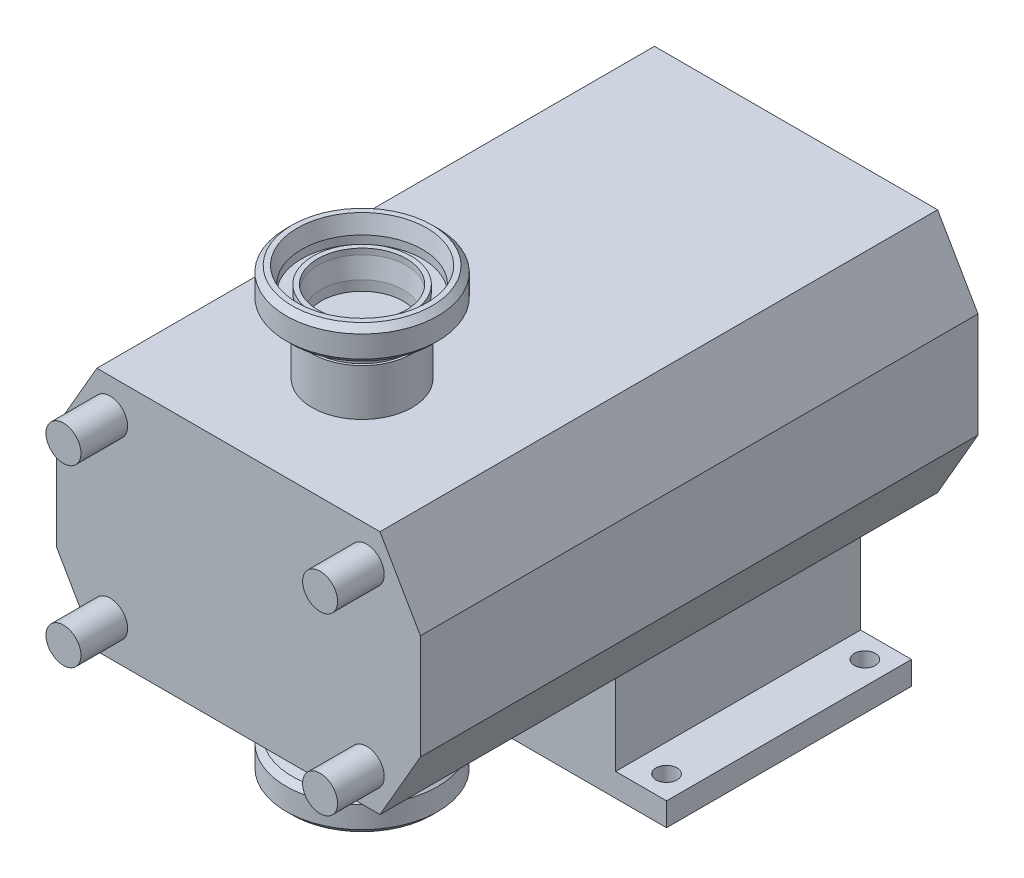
ISO-10303-21;
HEADER;
FILE_DESCRIPTION(('STEP AP214'),'2;1');
FILE_NAME('part.step','',(''),(''),'','','');
FILE_SCHEMA(('AUTOMOTIVE_DESIGN { 1 0 10303 214 1 1 1 1 }'));
ENDSEC;
DATA;
#1=APPLICATION_CONTEXT('core data for automotive mechanical design processes');
#2=APPLICATION_PROTOCOL_DEFINITION('international standard','automotive_design',2000,#1);
#3=PRODUCT_CONTEXT('',#1,'mechanical');
#4=PRODUCT('Part','Part','',(#3));
#5=PRODUCT_RELATED_PRODUCT_CATEGORY('part','',(#4));
#6=PRODUCT_DEFINITION_FORMATION('','',#4);
#7=PRODUCT_DEFINITION_CONTEXT('part definition',#1,'design');
#8=PRODUCT_DEFINITION('design','',#6,#7);
#9=PRODUCT_DEFINITION_SHAPE('','',#8);
#10=(LENGTH_UNIT() NAMED_UNIT(*) SI_UNIT(.MILLI.,.METRE.));
#11=(NAMED_UNIT(*) PLANE_ANGLE_UNIT() SI_UNIT($,.RADIAN.));
#12=(NAMED_UNIT(*) SI_UNIT($,.STERADIAN.) SOLID_ANGLE_UNIT());
#13=UNCERTAINTY_MEASURE_WITH_UNIT(LENGTH_MEASURE(1.E-05),#10,'distance_accuracy_value','');
#14=(GEOMETRIC_REPRESENTATION_CONTEXT(3) GLOBAL_UNCERTAINTY_ASSIGNED_CONTEXT((#13)) GLOBAL_UNIT_ASSIGNED_CONTEXT((#10,
#11,#12)) REPRESENTATION_CONTEXT('',''));
#15=CARTESIAN_POINT('',(0.,0.,0.));
#16=DIRECTION('',(0.,0.,1.));
#17=DIRECTION('',(1.,0.,0.));
#18=AXIS2_PLACEMENT_3D('',#15,#16,#17);
#19=CARTESIAN_POINT('',(-25.,0.,241.732657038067));
#20=DIRECTION('',(0.,0.,1.));
#21=DIRECTION('',(1.,0.,0.));
#22=AXIS2_PLACEMENT_3D('',#19,#20,#21);
#23=CYLINDRICAL_SURFACE('',#22,9.5);
#24=CARTESIAN_POINT('',(-25.,0.,-2.));
#25=DIRECTION('',(0.,0.,1.));
#26=DIRECTION('',(1.,0.,0.));
#27=AXIS2_PLACEMENT_3D('',#24,#25,#26);
#28=CIRCLE('',#27,9.5);
#29=CARTESIAN_POINT('',(-15.5,0.,-2.));
#30=VERTEX_POINT('',#29);
#31=EDGE_CURVE('P0_E277',#30,#30,#28,.T.);
#32=ORIENTED_EDGE('',*,*,#31,.F.);
#33=EDGE_LOOP('',(#32));
#34=FACE_BOUND('',#33,.T.);
#35=DIRECTION('',(0.,0.,1.));
#36=VECTOR('',#35,1.);
#37=CARTESIAN_POINT('',(-15.98612181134,2.99999999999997,241.732657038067));
#38=LINE('',#37,#36);
#39=CARTESIAN_POINT('',(-15.98612181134,3.,-42.));
#40=VERTEX_POINT('',#39);
#41=CARTESIAN_POINT('',(-15.98612181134,3.,-22.));
#42=VERTEX_POINT('',#41);
#43=EDGE_CURVE('P0_E178',#40,#42,#38,.T.);
#44=ORIENTED_EDGE('',*,*,#43,.F.);
#45=CARTESIAN_POINT('',(-25.,0.,-42.));
#46=DIRECTION('',(0.,0.,1.));
#47=DIRECTION('',(1.,0.,0.));
#48=AXIS2_PLACEMENT_3D('',#45,#46,#47);
#49=CIRCLE('',#48,9.5);
#50=CARTESIAN_POINT('',(-15.98612181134,-3.,-42.));
#51=VERTEX_POINT('',#50);
#52=EDGE_CURVE('P0_E176',#40,#51,#49,.T.);
#53=ORIENTED_EDGE('',*,*,#52,.T.);
#54=DIRECTION('',(0.,0.,1.));
#55=VECTOR('',#54,1.);
#56=CARTESIAN_POINT('',(-15.98612181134,-3.00000000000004,241.732657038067));
#57=LINE('',#56,#55);
#58=CARTESIAN_POINT('',(-15.98612181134,-3.00000000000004,-22.));
#59=VERTEX_POINT('',#58);
#60=EDGE_CURVE('P0_E39',#59,#51,#57,.F.);
#61=ORIENTED_EDGE('',*,*,#60,.F.);
#62=CARTESIAN_POINT('',(-15.5,0.,-25.));
#63=CARTESIAN_POINT('',(-15.5000006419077,0.16416708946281,-24.9999991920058));
#64=CARTESIAN_POINT('',(-15.5042954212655,0.328342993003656,-24.9864802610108));
#65=CARTESIAN_POINT('',(-15.5210070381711,0.651888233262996,-24.9329071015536));
#66=CARTESIAN_POINT('',(-15.5334255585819,0.811256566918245,-24.8928473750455));
#67=CARTESIAN_POINT('',(-15.5650291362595,1.12047453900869,-24.787682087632));
#68=CARTESIAN_POINT('',(-15.5842035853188,1.2703386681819,-24.7226157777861));
#69=CARTESIAN_POINT('',(-15.6273427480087,1.55702915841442,-24.5694529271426));
#70=CARTESIAN_POINT('',(-15.6513082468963,1.69385337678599,-24.4813526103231));
#71=CARTESIAN_POINT('',(-15.7023324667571,1.95488615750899,-24.2817053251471));
#72=CARTESIAN_POINT('',(-15.7294596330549,2.07862693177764,-24.1695643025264));
#73=CARTESIAN_POINT('',(-15.7833564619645,2.30589485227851,-23.9262834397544));
#74=CARTESIAN_POINT('',(-15.8101260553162,2.4094181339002,-23.7951399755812));
#75=CARTESIAN_POINT('',(-15.8610140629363,2.59586933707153,-23.5135024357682));
#76=CARTESIAN_POINT('',(-15.8850481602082,2.67820924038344,-23.3626023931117));
#77=CARTESIAN_POINT('',(-15.9267127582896,2.81614778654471,-23.0482150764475));
#78=CARTESIAN_POINT('',(-15.9443449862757,2.87175364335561,-22.8847312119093));
#79=CARTESIAN_POINT('',(-15.9704927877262,2.95292728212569,-22.5551021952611));
#80=CARTESIAN_POINT('',(-15.979271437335,2.97936420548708,-22.3891925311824));
#81=CARTESIAN_POINT('',(-15.9874987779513,3.00416514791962,-22.0550782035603));
#82=CARTESIAN_POINT('',(-15.9869500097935,3.00253681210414,-21.8868741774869));
#83=CARTESIAN_POINT('',(-15.9768164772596,2.97193247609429,-21.5601689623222));
#84=CARTESIAN_POINT('',(-15.9675982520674,2.94406576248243,-21.4015505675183));
#85=CARTESIAN_POINT('',(-15.9417605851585,2.86357596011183,-21.0913669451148));
#86=CARTESIAN_POINT('',(-15.9251403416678,2.81095018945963,-20.9398024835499));
#87=CARTESIAN_POINT('',(-15.8860934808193,2.68166168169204,-20.6454054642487));
#88=CARTESIAN_POINT('',(-15.8635843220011,2.60465367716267,-20.5027359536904));
#89=CARTESIAN_POINT('',(-15.8153331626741,2.4290264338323,-20.2319823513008));
#90=CARTESIAN_POINT('',(-15.7895903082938,2.33040148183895,-20.103902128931));
#91=CARTESIAN_POINT('',(-15.7363062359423,2.10891443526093,-19.859697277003));
#92=CARTESIAN_POINT('',(-15.7087370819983,1.98513792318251,-19.7444065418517));
#93=CARTESIAN_POINT('',(-15.6559621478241,1.71966506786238,-19.5360135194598));
#94=CARTESIAN_POINT('',(-15.6307565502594,1.57796734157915,-19.4429129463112));
#95=CARTESIAN_POINT('',(-15.5852743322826,1.27904248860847,-19.2809619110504));
#96=CARTESIAN_POINT('',(-15.5650393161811,1.12169880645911,-19.2123141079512));
#97=CARTESIAN_POINT('',(-15.5320787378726,0.796908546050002,-19.102710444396));
#98=CARTESIAN_POINT('',(-15.5193508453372,0.629465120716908,-19.0617459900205));
#99=CARTESIAN_POINT('',(-15.5032152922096,0.296303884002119,-19.0101010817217));
#100=CARTESIAN_POINT('',(-15.4994604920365,0.130777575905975,-18.9982920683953));
#101=CARTESIAN_POINT('',(-15.5006652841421,-0.199911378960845,-19.0021062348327));
#102=CARTESIAN_POINT('',(-15.5056235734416,-0.365074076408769,-19.017725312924));
#103=CARTESIAN_POINT('',(-15.5234691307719,-0.685969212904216,-19.0750481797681));
#104=CARTESIAN_POINT('',(-15.5361511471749,-0.841834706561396,-19.1160771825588));
#105=CARTESIAN_POINT('',(-15.5679556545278,-1.14442314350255,-19.2222287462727));
#106=CARTESIAN_POINT('',(-15.5870789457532,-1.2911449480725,-19.2873543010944));
#107=CARTESIAN_POINT('',(-15.6303910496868,-1.57531276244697,-19.4416461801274));
#108=CARTESIAN_POINT('',(-15.6546933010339,-1.71244019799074,-19.5313665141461));
#109=CARTESIAN_POINT('',(-15.7055878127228,-1.97006979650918,-19.7316386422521));
#110=CARTESIAN_POINT('',(-15.7321807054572,-2.09056734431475,-19.8421961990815));
#111=CARTESIAN_POINT('',(-15.7860170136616,-2.31658675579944,-20.0863131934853));
#112=CARTESIAN_POINT('',(-15.813243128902,-2.42130400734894,-20.2206231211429));
#113=CARTESIAN_POINT('',(-15.8641405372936,-2.60679013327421,-20.5055000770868));
#114=CARTESIAN_POINT('',(-15.8878118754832,-2.68755931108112,-20.6560668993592));
#115=CARTESIAN_POINT('',(-15.9286607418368,-2.82237097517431,-20.9689238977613));
#116=CARTESIAN_POINT('',(-15.9458617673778,-2.87651039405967,-21.1311690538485));
#117=CARTESIAN_POINT('',(-15.9716606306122,-2.95649944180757,-21.4631296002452));
#118=CARTESIAN_POINT('',(-15.9802618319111,-2.9823601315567,-21.6328420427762));
#119=CARTESIAN_POINT('',(-15.9875316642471,-3.0042524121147,-21.9664938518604));
#120=CARTESIAN_POINT('',(-15.9866406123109,-3.00160628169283,-22.1303379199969));
#121=CARTESIAN_POINT('',(-15.9760989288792,-2.96976166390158,-22.4551233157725));
#122=CARTESIAN_POINT('',(-15.9664487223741,-2.94056446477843,-22.6160647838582));
#123=CARTESIAN_POINT('',(-15.9397869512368,-2.8573397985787,-22.928056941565));
#124=CARTESIAN_POINT('',(-15.9228900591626,-2.80369834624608,-23.0792211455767));
#125=CARTESIAN_POINT('',(-15.8836701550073,-2.67341300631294,-23.3705239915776));
#126=CARTESIAN_POINT('',(-15.8613460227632,-2.59676436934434,-23.5106603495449));
#127=CARTESIAN_POINT('',(-15.8126776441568,-2.4190708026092,-23.781973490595));
#128=CARTESIAN_POINT('',(-15.7862086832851,-2.31717569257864,-23.9125710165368));
#129=CARTESIAN_POINT('',(-15.7327983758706,-2.0933684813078,-24.1552416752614));
#130=CARTESIAN_POINT('',(-15.705856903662,-1.97145098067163,-24.2673097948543));
#131=CARTESIAN_POINT('',(-15.6534511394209,-1.7061326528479,-24.4735138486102));
#132=CARTESIAN_POINT('',(-15.6280668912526,-1.56214764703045,-24.5669207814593));
#133=CARTESIAN_POINT('',(-15.5826524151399,-1.25971894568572,-24.728083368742));
#134=CARTESIAN_POINT('',(-15.5626201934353,-1.10128066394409,-24.7958485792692));
#135=CARTESIAN_POINT('',(-15.531467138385,-0.787271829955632,-24.8991975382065));
#136=CARTESIAN_POINT('',(-15.5197707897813,-0.632450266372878,-24.9368877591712));
#137=CARTESIAN_POINT('',(-15.5040377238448,-0.318421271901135,-24.9872867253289));
#138=CARTESIAN_POINT('',(-15.4999993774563,-0.159214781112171,-25.00000078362));
#139=CARTESIAN_POINT('',(-15.5,0.,-25.));
#140=B_SPLINE_CURVE_WITH_KNOTS('',3,(#62,#63,#64,#65,#66,#67,#68,#69,#70,#71,#72,#73,#74,#75,
#76,#77,#78,#79,#80,#81,#82,#83,#84,#85,#86,#87,#88,#89,#90,#91,#92,#93,#94,#95,#96,#97,#98,#99,
#100,#101,#102,#103,#104,#105,#106,#107,#108,#109,#110,#111,#112,#113,#114,#115,#116,#117,#118,
#119,#120,#121,#122,#123,#124,#125,#126,#127,#128,#129,#130,#131,#132,#133,#134,#135,#136,#137,
#138,#139),.UNSPECIFIED.,.T.,.F.,(4,2,2,2,2,2,2,2,2,2,2,2,2,2,2,2,2,2,2,2,2,2,2,2,2,2,2,2,2,2,2,
2,2,2,2,2,2,2,4),(0.,0.491915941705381,0.983933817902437,1.47518254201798,1.96651184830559,
2.47177433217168,2.97713330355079,3.49529138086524,4.0133095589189,4.51543663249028,
5.01742692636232,5.49910423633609,5.98083373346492,6.46971527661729,6.95872618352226,
7.47049694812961,7.98230723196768,8.49826565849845,9.01406383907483,9.50955937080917,
10.0049808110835,10.487778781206,10.9706367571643,11.4654198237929,11.9603399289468,
12.4753133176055,12.9902801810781,13.5033584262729,14.0162359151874,14.5054301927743,
14.9946007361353,15.4763007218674,15.9581002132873,16.4590917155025,16.9602185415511,
17.4781824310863,17.9959530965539,18.4731312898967,18.9502079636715),.UNSPECIFIED.);
#141=EDGE_CURVE('P0_E11',#42,#59,#140,.T.);
#142=ORIENTED_EDGE('',*,*,#141,.F.);
#143=EDGE_LOOP('',(#44,#53,#61,#142));
#144=FACE_BOUND('',#143,.T.);
#145=ADVANCED_FACE('P0_F17',(#34,#144),#23,.T.);
#146=CARTESIAN_POINT('',(-60.6794919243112,-52.5,239.));
#147=DIRECTION('',(0.,1.,0.));
#148=DIRECTION('',(-1.,0.,0.));
#149=AXIS2_PLACEMENT_3D('',#146,#147,#148);
#150=PLANE('',#149);
#151=CARTESIAN_POINT('',(0.,-52.5,186.));
#152=DIRECTION('',(0.,1.,0.));
#153=DIRECTION('',(-1.,0.,0.));
#154=AXIS2_PLACEMENT_3D('',#151,#152,#153);
#155=CIRCLE('',#154,21.5);
#156=CARTESIAN_POINT('',(-21.5,-52.5,186.));
#157=VERTEX_POINT('',#156);
#158=EDGE_CURVE('P0_E192',#157,#157,#155,.T.);
#159=ORIENTED_EDGE('',*,*,#158,.T.);
#160=EDGE_LOOP('',(#159));
#161=FACE_BOUND('',#160,.T.);
#162=DIRECTION('',(1.,0.,0.));
#163=VECTOR('',#162,1.);
#164=CARTESIAN_POINT('',(-60.6794919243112,-52.5,0.));
#165=LINE('',#164,#163);
#166=CARTESIAN_POINT('',(-60.6794919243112,-52.5,0.));
#167=VERTEX_POINT('',#166);
#168=CARTESIAN_POINT('',(60.6794919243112,-52.5,0.));
#169=VERTEX_POINT('',#168);
#170=EDGE_CURVE('P0_E337',#167,#169,#165,.T.);
#171=ORIENTED_EDGE('',*,*,#170,.T.);
#172=DIRECTION('',(0.,0.,-1.));
#173=VECTOR('',#172,1.);
#174=CARTESIAN_POINT('',(60.6794919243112,-52.5,239.));
#175=LINE('',#174,#173);
#176=CARTESIAN_POINT('',(60.6794919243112,-52.5,239.));
#177=VERTEX_POINT('',#176);
#178=EDGE_CURVE('P0_E347',#177,#169,#175,.T.);
#179=ORIENTED_EDGE('',*,*,#178,.F.);
#180=DIRECTION('',(1.,0.,0.));
#181=VECTOR('',#180,1.);
#182=CARTESIAN_POINT('',(-60.6794919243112,-52.5,239.));
#183=LINE('',#182,#181);
#184=CARTESIAN_POINT('',(-60.6794919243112,-52.5,239.));
#185=VERTEX_POINT('',#184);
#186=EDGE_CURVE('P0_E320',#185,#177,#183,.T.);
#187=ORIENTED_EDGE('',*,*,#186,.F.);
#188=DIRECTION('',(0.,0.,-1.));
#189=VECTOR('',#188,1.);
#190=CARTESIAN_POINT('',(-60.6794919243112,-52.5,239.));
#191=LINE('',#190,#189);
#192=EDGE_CURVE('P0_E350',#185,#167,#191,.T.);
#193=ORIENTED_EDGE('',*,*,#192,.T.);
#194=EDGE_LOOP('',(#171,#179,#187,#193));
#195=FACE_BOUND('',#194,.T.);
#196=DIRECTION('',(1.,0.,0.));
#197=VECTOR('',#196,1.);
#198=CARTESIAN_POINT('',(45.6794919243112,-52.5,18.));
#199=LINE('',#198,#197);
#200=CARTESIAN_POINT('',(-45.6794919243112,-52.5,18.));
#201=VERTEX_POINT('',#200);
#202=CARTESIAN_POINT('',(45.6794919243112,-52.5,18.));
#203=VERTEX_POINT('',#202);
#204=EDGE_CURVE('P0_E220',#201,#203,#199,.T.);
#205=ORIENTED_EDGE('',*,*,#204,.F.);
#206=DIRECTION('',(0.,0.,1.));
#207=VECTOR('',#206,1.);
#208=CARTESIAN_POINT('',(-45.6794919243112,-52.5,18.));
#209=LINE('',#208,#207);
#210=CARTESIAN_POINT('',(-45.6794919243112,-52.5,123.));
#211=VERTEX_POINT('',#210);
#212=EDGE_CURVE('P0_E238',#201,#211,#209,.T.);
#213=ORIENTED_EDGE('',*,*,#212,.T.);
#214=DIRECTION('',(1.,0.,0.));
#215=VECTOR('',#214,1.);
#216=CARTESIAN_POINT('',(45.6794919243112,-52.5,123.));
#217=LINE('',#216,#215);
#218=CARTESIAN_POINT('',(45.6794919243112,-52.5,123.));
#219=VERTEX_POINT('',#218);
#220=EDGE_CURVE('P0_E219',#211,#219,#217,.T.);
#221=ORIENTED_EDGE('',*,*,#220,.T.);
#222=DIRECTION('',(0.,0.,1.));
#223=VECTOR('',#222,1.);
#224=CARTESIAN_POINT('',(45.6794919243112,-52.5,18.));
#225=LINE('',#224,#223);
#226=EDGE_CURVE('P0_E274',#203,#219,#225,.T.);
#227=ORIENTED_EDGE('',*,*,#226,.F.);
#228=EDGE_LOOP('',(#205,#213,#221,#227));
#229=FACE_BOUND('',#228,.T.);
#230=ADVANCED_FACE('P0_F393',(#161,#195,#229),#150,.F.);
#231=CARTESIAN_POINT('',(90.9903810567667,0.,0.));
#232=DIRECTION('',(0.,0.,1.));
#233=DIRECTION('',(1.,0.,0.));
#234=AXIS2_PLACEMENT_3D('',#231,#232,#233);
#235=PLANE('',#234);
#236=DIRECTION('',(-0.500000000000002,0.866025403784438,0.));
#237=VECTOR('',#236,1.);
#238=CARTESIAN_POINT('',(60.6794919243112,52.5,0.));
#239=LINE('',#238,#237);
#240=CARTESIAN_POINT('',(78.,22.5,0.));
#241=VERTEX_POINT('',#240);
#242=CARTESIAN_POINT('',(60.6794919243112,52.5,0.));
#243=VERTEX_POINT('',#242);
#244=EDGE_CURVE('P0_E305',#241,#243,#239,.T.);
#245=ORIENTED_EDGE('',*,*,#244,.F.);
#246=DIRECTION('',(0.,1.,0.));
#247=VECTOR('',#246,1.);
#248=CARTESIAN_POINT('',(78.,22.5,0.));
#249=LINE('',#248,#247);
#250=CARTESIAN_POINT('',(78.,-22.5,0.));
#251=VERTEX_POINT('',#250);
#252=EDGE_CURVE('P0_E312',#251,#241,#249,.T.);
#253=ORIENTED_EDGE('',*,*,#252,.F.);
#254=DIRECTION('',(0.500000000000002,0.866025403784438,0.));
#255=VECTOR('',#254,1.);
#256=CARTESIAN_POINT('',(60.6794919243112,-52.5,0.));
#257=LINE('',#256,#255);
#258=EDGE_CURVE('P0_E339',#169,#251,#257,.T.);
#259=ORIENTED_EDGE('',*,*,#258,.F.);
#260=ORIENTED_EDGE('',*,*,#170,.F.);
#261=DIRECTION('',(0.500000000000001,-0.866025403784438,0.));
#262=VECTOR('',#261,1.);
#263=CARTESIAN_POINT('',(-60.6794919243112,-52.5,0.));
#264=LINE('',#263,#262);
#265=CARTESIAN_POINT('',(-78.,-22.5,0.));
#266=VERTEX_POINT('',#265);
#267=EDGE_CURVE('P0_E335',#266,#167,#264,.T.);
#268=ORIENTED_EDGE('',*,*,#267,.F.);
#269=DIRECTION('',(0.,-1.,0.));
#270=VECTOR('',#269,1.);
#271=CARTESIAN_POINT('',(-78.,22.5,0.));
#272=LINE('',#271,#270);
#273=CARTESIAN_POINT('',(-78.,22.5,0.));
#274=VERTEX_POINT('',#273);
#275=EDGE_CURVE('P0_E333',#274,#266,#272,.T.);
#276=ORIENTED_EDGE('',*,*,#275,.F.);
#277=DIRECTION('',(-0.500000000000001,-0.866025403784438,0.));
#278=VECTOR('',#277,1.);
#279=CARTESIAN_POINT('',(-60.6794919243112,52.5,0.));
#280=LINE('',#279,#278);
#281=CARTESIAN_POINT('',(-60.6794919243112,52.5,0.));
#282=VERTEX_POINT('',#281);
#283=EDGE_CURVE('P0_E331',#282,#274,#280,.T.);
#284=ORIENTED_EDGE('',*,*,#283,.F.);
#285=DIRECTION('',(-1.,0.,0.));
#286=VECTOR('',#285,1.);
#287=CARTESIAN_POINT('',(-60.6794919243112,52.5,0.));
#288=LINE('',#287,#286);
#289=EDGE_CURVE('P0_E329',#243,#282,#288,.T.);
#290=ORIENTED_EDGE('',*,*,#289,.F.);
#291=EDGE_LOOP('',(#245,#253,#259,#260,#268,#276,#284,#290));
#292=FACE_BOUND('',#291,.T.);
#293=CARTESIAN_POINT('',(-25.,0.,0.));
#294=DIRECTION('',(0.,0.,1.));
#295=DIRECTION('',(1.,0.,0.));
#296=AXIS2_PLACEMENT_3D('',#293,#294,#295);
#297=CIRCLE('',#296,12.5);
#298=CARTESIAN_POINT('',(-12.5,0.,0.));
#299=VERTEX_POINT('',#298);
#300=EDGE_CURVE('P0_E29',#299,#299,#297,.F.);
#301=ORIENTED_EDGE('',*,*,#300,.F.);
#302=EDGE_LOOP('',(#301));
#303=FACE_BOUND('',#302,.T.);
#304=ADVANCED_FACE('P0_F399',(#292,#303),#235,.F.);
#305=CARTESIAN_POINT('',(90.9903810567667,0.,239.));
#306=DIRECTION('',(0.,0.,1.));
#307=DIRECTION('',(1.,0.,0.));
#308=AXIS2_PLACEMENT_3D('',#305,#306,#307);
#309=PLANE('',#308);
#310=CARTESIAN_POINT('',(55.,-37.5,239.));
#311=DIRECTION('',(0.,0.,1.));
#312=DIRECTION('',(1.,0.,0.));
#313=AXIS2_PLACEMENT_3D('',#310,#311,#312);
#314=CIRCLE('',#313,7.49999999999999);
#315=CARTESIAN_POINT('',(62.5,-37.5,239.));
#316=VERTEX_POINT('',#315);
#317=EDGE_CURVE('P0_E287',#316,#316,#314,.T.);
#318=ORIENTED_EDGE('',*,*,#317,.F.);
#319=EDGE_LOOP('',(#318));
#320=FACE_BOUND('',#319,.T.);
#321=CARTESIAN_POINT('',(-55.,37.5,239.));
#322=DIRECTION('',(0.,0.,1.));
#323=DIRECTION('',(1.,0.,0.));
#324=AXIS2_PLACEMENT_3D('',#321,#322,#323);
#325=CIRCLE('',#324,7.5);
#326=CARTESIAN_POINT('',(-47.5,37.5,239.));
#327=VERTEX_POINT('',#326);
#328=EDGE_CURVE('P0_E299',#327,#327,#325,.T.);
#329=ORIENTED_EDGE('',*,*,#328,.F.);
#330=EDGE_LOOP('',(#329));
#331=FACE_BOUND('',#330,.T.);
#332=DIRECTION('',(-0.500000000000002,0.866025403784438,0.));
#333=VECTOR('',#332,1.);
#334=CARTESIAN_POINT('',(60.6794919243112,52.5,239.));
#335=LINE('',#334,#333);
#336=CARTESIAN_POINT('',(78.,22.5,239.));
#337=VERTEX_POINT('',#336);
#338=CARTESIAN_POINT('',(60.6794919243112,52.5,239.));
#339=VERTEX_POINT('',#338);
#340=EDGE_CURVE('P0_E308',#337,#339,#335,.T.);
#341=ORIENTED_EDGE('',*,*,#340,.T.);
#342=DIRECTION('',(-1.,0.,0.));
#343=VECTOR('',#342,1.);
#344=CARTESIAN_POINT('',(-60.6794919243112,52.5,239.));
#345=LINE('',#344,#343);
#346=CARTESIAN_POINT('',(-60.6794919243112,52.5,239.));
#347=VERTEX_POINT('',#346);
#348=EDGE_CURVE('P0_E311',#339,#347,#345,.T.);
#349=ORIENTED_EDGE('',*,*,#348,.T.);
#350=DIRECTION('',(-0.500000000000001,-0.866025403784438,0.));
#351=VECTOR('',#350,1.);
#352=CARTESIAN_POINT('',(-60.6794919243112,52.5,239.));
#353=LINE('',#352,#351);
#354=CARTESIAN_POINT('',(-78.,22.5,239.));
#355=VERTEX_POINT('',#354);
#356=EDGE_CURVE('P0_E314',#347,#355,#353,.T.);
#357=ORIENTED_EDGE('',*,*,#356,.T.);
#358=DIRECTION('',(0.,-1.,0.));
#359=VECTOR('',#358,1.);
#360=CARTESIAN_POINT('',(-78.,22.5,239.));
#361=LINE('',#360,#359);
#362=CARTESIAN_POINT('',(-78.,-22.5,239.));
#363=VERTEX_POINT('',#362);
#364=EDGE_CURVE('P0_E316',#355,#363,#361,.T.);
#365=ORIENTED_EDGE('',*,*,#364,.T.);
#366=DIRECTION('',(0.500000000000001,-0.866025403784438,0.));
#367=VECTOR('',#366,1.);
#368=CARTESIAN_POINT('',(-60.6794919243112,-52.5,239.));
#369=LINE('',#368,#367);
#370=EDGE_CURVE('P0_E318',#363,#185,#369,.T.);
#371=ORIENTED_EDGE('',*,*,#370,.T.);
#372=ORIENTED_EDGE('',*,*,#186,.T.);
#373=DIRECTION('',(0.500000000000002,0.866025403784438,0.));
#374=VECTOR('',#373,1.);
#375=CARTESIAN_POINT('',(60.6794919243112,-52.5,239.));
#376=LINE('',#375,#374);
#377=CARTESIAN_POINT('',(78.,-22.5,239.));
#378=VERTEX_POINT('',#377);
#379=EDGE_CURVE('P0_E322',#177,#378,#376,.T.);
#380=ORIENTED_EDGE('',*,*,#379,.T.);
#381=DIRECTION('',(0.,1.,0.));
#382=VECTOR('',#381,1.);
#383=CARTESIAN_POINT('',(78.,22.5,239.));
#384=LINE('',#383,#382);
#385=EDGE_CURVE('P0_E324',#378,#337,#384,.T.);
#386=ORIENTED_EDGE('',*,*,#385,.T.);
#387=EDGE_LOOP('',(#341,#349,#357,#365,#371,#372,#380,#386));
#388=FACE_BOUND('',#387,.T.);
#389=CARTESIAN_POINT('',(55.,37.5,239.));
#390=DIRECTION('',(0.,0.,1.));
#391=DIRECTION('',(1.,0.,0.));
#392=AXIS2_PLACEMENT_3D('',#389,#390,#391);
#393=CIRCLE('',#392,7.49999999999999);
#394=CARTESIAN_POINT('',(62.5,37.5,239.));
#395=VERTEX_POINT('',#394);
#396=EDGE_CURVE('P0_E293',#395,#395,#393,.T.);
#397=ORIENTED_EDGE('',*,*,#396,.F.);
#398=EDGE_LOOP('',(#397));
#399=FACE_BOUND('',#398,.T.);
#400=CARTESIAN_POINT('',(-55.,-37.5,239.));
#401=DIRECTION('',(0.,0.,1.));
#402=DIRECTION('',(1.,0.,0.));
#403=AXIS2_PLACEMENT_3D('',#400,#401,#402);
#404=CIRCLE('',#403,7.5);
#405=CARTESIAN_POINT('',(-47.5,-37.5,239.));
#406=VERTEX_POINT('',#405);
#407=EDGE_CURVE('P0_E283',#406,#406,#404,.T.);
#408=ORIENTED_EDGE('',*,*,#407,.F.);
#409=EDGE_LOOP('',(#408));
#410=FACE_BOUND('',#409,.T.);
#411=ADVANCED_FACE('P0_F448',(#320,#331,#388,#399,#410),#309,.T.);
#412=CARTESIAN_POINT('',(60.6794919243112,52.5,239.));
#413=DIRECTION('',(-0.866025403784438,-0.500000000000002,0.));
#414=DIRECTION('',(0.500000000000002,-0.866025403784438,0.));
#415=AXIS2_PLACEMENT_3D('',#412,#413,#414);
#416=PLANE('',#415);
#417=ORIENTED_EDGE('',*,*,#244,.T.);
#418=DIRECTION('',(0.,0.,-1.));
#419=VECTOR('',#418,1.);
#420=CARTESIAN_POINT('',(60.6794919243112,52.5,239.));
#421=LINE('',#420,#419);
#422=EDGE_CURVE('P0_E362',#339,#243,#421,.T.);
#423=ORIENTED_EDGE('',*,*,#422,.F.);
#424=ORIENTED_EDGE('',*,*,#340,.F.);
#425=DIRECTION('',(0.,0.,-1.));
#426=VECTOR('',#425,1.);
#427=CARTESIAN_POINT('',(78.,22.5,239.));
#428=LINE('',#427,#426);
#429=EDGE_CURVE('P0_E326',#337,#241,#428,.T.);
#430=ORIENTED_EDGE('',*,*,#429,.T.);
#431=EDGE_LOOP('',(#417,#423,#424,#430));
#432=FACE_BOUND('',#431,.T.);
#433=ADVANCED_FACE('P0_F19',(#432),#416,.F.);
#434=CARTESIAN_POINT('',(-60.6794919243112,52.5,239.));
#435=DIRECTION('',(0.,-1.,0.));
#436=DIRECTION('',(1.,0.,0.));
#437=AXIS2_PLACEMENT_3D('',#434,#435,#436);
#438=PLANE('',#437);
#439=CARTESIAN_POINT('',(0.,52.5,186.));
#440=DIRECTION('',(0.,-1.,0.));
#441=DIRECTION('',(1.,0.,0.));
#442=AXIS2_PLACEMENT_3D('',#439,#440,#441);
#443=CIRCLE('',#442,21.5);
#444=CARTESIAN_POINT('',(21.5,52.5,186.));
#445=VERTEX_POINT('',#444);
#446=EDGE_CURVE('P0_E191',#445,#445,#443,.T.);
#447=ORIENTED_EDGE('',*,*,#446,.T.);
#448=EDGE_LOOP('',(#447));
#449=FACE_BOUND('',#448,.T.);
#450=ORIENTED_EDGE('',*,*,#289,.T.);
#451=DIRECTION('',(0.,0.,-1.));
#452=VECTOR('',#451,1.);
#453=CARTESIAN_POINT('',(-60.6794919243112,52.5,239.));
#454=LINE('',#453,#452);
#455=EDGE_CURVE('P0_E359',#347,#282,#454,.T.);
#456=ORIENTED_EDGE('',*,*,#455,.F.);
#457=ORIENTED_EDGE('',*,*,#348,.F.);
#458=ORIENTED_EDGE('',*,*,#422,.T.);
#459=EDGE_LOOP('',(#450,#456,#457,#458));
#460=FACE_BOUND('',#459,.T.);
#461=ADVANCED_FACE('P0_F369',(#449,#460),#438,.F.);
#462=CARTESIAN_POINT('',(-60.6794919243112,52.5,239.));
#463=DIRECTION('',(0.866025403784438,-0.500000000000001,0.));
#464=DIRECTION('',(0.500000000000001,0.866025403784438,0.));
#465=AXIS2_PLACEMENT_3D('',#462,#463,#464);
#466=PLANE('',#465);
#467=ORIENTED_EDGE('',*,*,#283,.T.);
#468=DIRECTION('',(0.,0.,-1.));
#469=VECTOR('',#468,1.);
#470=CARTESIAN_POINT('',(-78.,22.5,239.));
#471=LINE('',#470,#469);
#472=EDGE_CURVE('P0_E356',#355,#274,#471,.T.);
#473=ORIENTED_EDGE('',*,*,#472,.F.);
#474=ORIENTED_EDGE('',*,*,#356,.F.);
#475=ORIENTED_EDGE('',*,*,#455,.T.);
#476=EDGE_LOOP('',(#467,#473,#474,#475));
#477=FACE_BOUND('',#476,.T.);
#478=ADVANCED_FACE('P0_F469',(#477),#466,.F.);
#479=CARTESIAN_POINT('',(-78.,22.5,239.));
#480=DIRECTION('',(1.,0.,0.));
#481=DIRECTION('',(0.,0.,-1.));
#482=AXIS2_PLACEMENT_3D('',#479,#480,#481);
#483=PLANE('',#482);
#484=ORIENTED_EDGE('',*,*,#275,.T.);
#485=DIRECTION('',(0.,0.,-1.));
#486=VECTOR('',#485,1.);
#487=CARTESIAN_POINT('',(-78.,-22.5,239.));
#488=LINE('',#487,#486);
#489=EDGE_CURVE('P0_E353',#363,#266,#488,.T.);
#490=ORIENTED_EDGE('',*,*,#489,.F.);
#491=ORIENTED_EDGE('',*,*,#364,.F.);
#492=ORIENTED_EDGE('',*,*,#472,.T.);
#493=EDGE_LOOP('',(#484,#490,#491,#492));
#494=FACE_BOUND('',#493,.T.);
#495=ADVANCED_FACE('P0_F465',(#494),#483,.F.);
#496=CARTESIAN_POINT('',(-60.6794919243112,-52.5,239.));
#497=DIRECTION('',(0.866025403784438,0.500000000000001,0.));
#498=DIRECTION('',(-0.500000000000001,0.866025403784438,0.));
#499=AXIS2_PLACEMENT_3D('',#496,#497,#498);
#500=PLANE('',#499);
#501=ORIENTED_EDGE('',*,*,#267,.T.);
#502=ORIENTED_EDGE('',*,*,#192,.F.);
#503=ORIENTED_EDGE('',*,*,#370,.F.);
#504=ORIENTED_EDGE('',*,*,#489,.T.);
#505=EDGE_LOOP('',(#501,#502,#503,#504));
#506=FACE_BOUND('',#505,.T.);
#507=ADVANCED_FACE('P0_F460',(#506),#500,.F.);
#508=CARTESIAN_POINT('',(60.6794919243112,-52.5,239.));
#509=DIRECTION('',(-0.866025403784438,0.500000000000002,0.));
#510=DIRECTION('',(-0.500000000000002,-0.866025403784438,0.));
#511=AXIS2_PLACEMENT_3D('',#508,#509,#510);
#512=PLANE('',#511);
#513=ORIENTED_EDGE('',*,*,#258,.T.);
#514=DIRECTION('',(0.,0.,-1.));
#515=VECTOR('',#514,1.);
#516=CARTESIAN_POINT('',(78.,-22.5,239.));
#517=LINE('',#516,#515);
#518=EDGE_CURVE('P0_E344',#378,#251,#517,.T.);
#519=ORIENTED_EDGE('',*,*,#518,.F.);
#520=ORIENTED_EDGE('',*,*,#379,.F.);
#521=ORIENTED_EDGE('',*,*,#178,.T.);
#522=EDGE_LOOP('',(#513,#519,#520,#521));
#523=FACE_BOUND('',#522,.T.);
#524=ADVANCED_FACE('P0_F457',(#523),#512,.F.);
#525=CARTESIAN_POINT('',(78.,22.5,239.));
#526=DIRECTION('',(-1.,0.,0.));
#527=DIRECTION('',(0.,0.,1.));
#528=AXIS2_PLACEMENT_3D('',#525,#526,#527);
#529=PLANE('',#528);
#530=ORIENTED_EDGE('',*,*,#252,.T.);
#531=ORIENTED_EDGE('',*,*,#429,.F.);
#532=ORIENTED_EDGE('',*,*,#385,.F.);
#533=ORIENTED_EDGE('',*,*,#518,.T.);
#534=EDGE_LOOP('',(#530,#531,#532,#533));
#535=FACE_BOUND('',#534,.T.);
#536=ADVANCED_FACE('P0_F446',(#535),#529,.F.);
#537=CARTESIAN_POINT('',(-55.,37.5,259.));
#538=DIRECTION('',(0.,0.,-1.));
#539=DIRECTION('',(-1.,0.,0.));
#540=AXIS2_PLACEMENT_3D('',#537,#538,#539);
#541=CYLINDRICAL_SURFACE('',#540,7.5);
#542=CARTESIAN_POINT('',(-55.,37.5,259.));
#543=DIRECTION('',(0.,0.,1.));
#544=DIRECTION('',(1.,0.,0.));
#545=AXIS2_PLACEMENT_3D('',#542,#543,#544);
#546=CIRCLE('',#545,7.5);
#547=CARTESIAN_POINT('',(-47.5,37.5,259.));
#548=VERTEX_POINT('',#547);
#549=EDGE_CURVE('P0_E302',#548,#548,#546,.T.);
#550=ORIENTED_EDGE('',*,*,#549,.F.);
#551=EDGE_LOOP('',(#550));
#552=FACE_BOUND('',#551,.T.);
#553=ORIENTED_EDGE('',*,*,#328,.T.);
#554=EDGE_LOOP('',(#553));
#555=FACE_BOUND('',#554,.T.);
#556=ADVANCED_FACE('P0_F442',(#552,#555),#541,.T.);
#557=CARTESIAN_POINT('',(-55.,37.5,259.));
#558=DIRECTION('',(0.,0.,1.));
#559=DIRECTION('',(1.,0.,0.));
#560=AXIS2_PLACEMENT_3D('',#557,#558,#559);
#561=PLANE('',#560);
#562=ORIENTED_EDGE('',*,*,#549,.T.);
#563=EDGE_LOOP('',(#562));
#564=FACE_BOUND('',#563,.T.);
#565=ADVANCED_FACE('P0_F438',(#564),#561,.T.);
#566=CARTESIAN_POINT('',(55.,37.5,259.));
#567=DIRECTION('',(0.,0.,-1.));
#568=DIRECTION('',(-1.,0.,0.));
#569=AXIS2_PLACEMENT_3D('',#566,#567,#568);
#570=CYLINDRICAL_SURFACE('',#569,7.49999999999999);
#571=CARTESIAN_POINT('',(55.,37.5,259.));
#572=DIRECTION('',(0.,0.,1.));
#573=DIRECTION('',(1.,0.,0.));
#574=AXIS2_PLACEMENT_3D('',#571,#572,#573);
#575=CIRCLE('',#574,7.49999999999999);
#576=CARTESIAN_POINT('',(62.5,37.5,259.));
#577=VERTEX_POINT('',#576);
#578=EDGE_CURVE('P0_E296',#577,#577,#575,.T.);
#579=ORIENTED_EDGE('',*,*,#578,.F.);
#580=EDGE_LOOP('',(#579));
#581=FACE_BOUND('',#580,.T.);
#582=ORIENTED_EDGE('',*,*,#396,.T.);
#583=EDGE_LOOP('',(#582));
#584=FACE_BOUND('',#583,.T.);
#585=ADVANCED_FACE('P0_F434',(#581,#584),#570,.T.);
#586=CARTESIAN_POINT('',(55.,37.5,259.));
#587=DIRECTION('',(0.,0.,1.));
#588=DIRECTION('',(1.,0.,0.));
#589=AXIS2_PLACEMENT_3D('',#586,#587,#588);
#590=PLANE('',#589);
#591=ORIENTED_EDGE('',*,*,#578,.T.);
#592=EDGE_LOOP('',(#591));
#593=FACE_BOUND('',#592,.T.);
#594=ADVANCED_FACE('P0_F430',(#593),#590,.T.);
#595=CARTESIAN_POINT('',(55.,-37.5,259.));
#596=DIRECTION('',(0.,0.,-1.));
#597=DIRECTION('',(-1.,0.,0.));
#598=AXIS2_PLACEMENT_3D('',#595,#596,#597);
#599=CYLINDRICAL_SURFACE('',#598,7.49999999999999);
#600=CARTESIAN_POINT('',(55.,-37.5,259.));
#601=DIRECTION('',(0.,0.,1.));
#602=DIRECTION('',(1.,0.,0.));
#603=AXIS2_PLACEMENT_3D('',#600,#601,#602);
#604=CIRCLE('',#603,7.49999999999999);
#605=CARTESIAN_POINT('',(62.5,-37.5,259.));
#606=VERTEX_POINT('',#605);
#607=EDGE_CURVE('P0_E290',#606,#606,#604,.T.);
#608=ORIENTED_EDGE('',*,*,#607,.F.);
#609=EDGE_LOOP('',(#608));
#610=FACE_BOUND('',#609,.T.);
#611=ORIENTED_EDGE('',*,*,#317,.T.);
#612=EDGE_LOOP('',(#611));
#613=FACE_BOUND('',#612,.T.);
#614=ADVANCED_FACE('P0_F426',(#610,#613),#599,.T.);
#615=CARTESIAN_POINT('',(55.,-37.5,259.));
#616=DIRECTION('',(0.,0.,1.));
#617=DIRECTION('',(1.,0.,0.));
#618=AXIS2_PLACEMENT_3D('',#615,#616,#617);
#619=PLANE('',#618);
#620=ORIENTED_EDGE('',*,*,#607,.T.);
#621=EDGE_LOOP('',(#620));
#622=FACE_BOUND('',#621,.T.);
#623=ADVANCED_FACE('P0_F422',(#622),#619,.T.);
#624=CARTESIAN_POINT('',(-55.,-37.5,259.));
#625=DIRECTION('',(0.,0.,-1.));
#626=DIRECTION('',(-1.,0.,0.));
#627=AXIS2_PLACEMENT_3D('',#624,#625,#626);
#628=CYLINDRICAL_SURFACE('',#627,7.5);
#629=CARTESIAN_POINT('',(-55.,-37.5,259.));
#630=DIRECTION('',(0.,0.,1.));
#631=DIRECTION('',(1.,0.,0.));
#632=AXIS2_PLACEMENT_3D('',#629,#630,#631);
#633=CIRCLE('',#632,7.5);
#634=CARTESIAN_POINT('',(-47.5,-37.5,259.));
#635=VERTEX_POINT('',#634);
#636=EDGE_CURVE('P0_E284',#635,#635,#633,.T.);
#637=ORIENTED_EDGE('',*,*,#636,.F.);
#638=EDGE_LOOP('',(#637));
#639=FACE_BOUND('',#638,.T.);
#640=ORIENTED_EDGE('',*,*,#407,.T.);
#641=EDGE_LOOP('',(#640));
#642=FACE_BOUND('',#641,.T.);
#643=ADVANCED_FACE('P0_F418',(#639,#642),#628,.T.);
#644=CARTESIAN_POINT('',(-55.,-37.5,259.));
#645=DIRECTION('',(0.,0.,1.));
#646=DIRECTION('',(1.,0.,0.));
#647=AXIS2_PLACEMENT_3D('',#644,#645,#646);
#648=PLANE('',#647);
#649=ORIENTED_EDGE('',*,*,#636,.T.);
#650=EDGE_LOOP('',(#649));
#651=FACE_BOUND('',#650,.T.);
#652=ADVANCED_FACE('P0_F414',(#651),#648,.T.);
#653=CARTESIAN_POINT('',(-25.,0.,241.732657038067));
#654=DIRECTION('',(0.,0.,1.));
#655=DIRECTION('',(1.,0.,0.));
#656=AXIS2_PLACEMENT_3D('',#653,#654,#655);
#657=CYLINDRICAL_SURFACE('',#656,12.5);
#658=ORIENTED_EDGE('',*,*,#300,.T.);
#659=EDGE_LOOP('',(#658));
#660=FACE_BOUND('',#659,.T.);
#661=CARTESIAN_POINT('',(-25.,0.,-2.));
#662=DIRECTION('',(0.,0.,1.));
#663=DIRECTION('',(1.,0.,0.));
#664=AXIS2_PLACEMENT_3D('',#661,#662,#663);
#665=CIRCLE('',#664,12.5);
#666=CARTESIAN_POINT('',(-12.5,0.,-2.));
#667=VERTEX_POINT('',#666);
#668=EDGE_CURVE('P0_E280',#667,#667,#665,.T.);
#669=ORIENTED_EDGE('',*,*,#668,.T.);
#670=EDGE_LOOP('',(#669));
#671=FACE_BOUND('',#670,.T.);
#672=ADVANCED_FACE('P0_F410',(#660,#671),#657,.T.);
#673=CARTESIAN_POINT('',(-25.,12.5,-2.));
#674=DIRECTION('',(0.,0.,1.));
#675=DIRECTION('',(1.,0.,0.));
#676=AXIS2_PLACEMENT_3D('',#673,#674,#675);
#677=PLANE('',#676);
#678=ORIENTED_EDGE('',*,*,#668,.F.);
#679=EDGE_LOOP('',(#678));
#680=FACE_BOUND('',#679,.T.);
#681=ORIENTED_EDGE('',*,*,#31,.T.);
#682=EDGE_LOOP('',(#681));
#683=FACE_BOUND('',#682,.T.);
#684=ADVANCED_FACE('P0_F407',(#680,#683),#677,.F.);
#685=CARTESIAN_POINT('',(-25.,9.5,-42.));
#686=DIRECTION('',(0.,0.,1.));
#687=DIRECTION('',(1.,0.,0.));
#688=AXIS2_PLACEMENT_3D('',#685,#686,#687);
#689=PLANE('',#688);
#690=ORIENTED_EDGE('',*,*,#52,.F.);
#691=DIRECTION('',(-1.,0.,0.));
#692=VECTOR('',#691,1.);
#693=CARTESIAN_POINT('',(-12.9,3.,-42.));
#694=LINE('',#693,#692);
#695=CARTESIAN_POINT('',(-12.9,3.,-42.));
#696=VERTEX_POINT('',#695);
#697=EDGE_CURVE('P0_E158',#696,#40,#694,.T.);
#698=ORIENTED_EDGE('',*,*,#697,.F.);
#699=DIRECTION('',(0.,1.,0.));
#700=VECTOR('',#699,1.);
#701=CARTESIAN_POINT('',(-12.9,3.,-42.));
#702=LINE('',#701,#700);
#703=CARTESIAN_POINT('',(-12.9,-3.,-42.));
#704=VERTEX_POINT('',#703);
#705=EDGE_CURVE('P0_E164',#704,#696,#702,.T.);
#706=ORIENTED_EDGE('',*,*,#705,.F.);
#707=DIRECTION('',(-1.,0.,0.));
#708=VECTOR('',#707,1.);
#709=CARTESIAN_POINT('',(-12.9,-3.,-42.));
#710=LINE('',#709,#708);
#711=EDGE_CURVE('P0_E768',#704,#51,#710,.T.);
#712=ORIENTED_EDGE('',*,*,#711,.T.);
#713=EDGE_LOOP('',(#690,#698,#706,#712));
#714=FACE_BOUND('',#713,.T.);
#715=ADVANCED_FACE('P0_F175',(#714),#689,.F.);
#716=CARTESIAN_POINT('',(45.6794919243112,-52.5,18.));
#717=DIRECTION('',(-1.,0.,0.));
#718=DIRECTION('',(0.,-1.,0.));
#719=AXIS2_PLACEMENT_3D('',#716,#717,#718);
#720=PLANE('',#719);
#721=DIRECTION('',(0.,-1.,0.));
#722=VECTOR('',#721,1.);
#723=CARTESIAN_POINT('',(45.6794919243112,-52.5,123.));
#724=LINE('',#723,#722);
#725=CARTESIAN_POINT('',(45.6794919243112,-102.,123.));
#726=VERTEX_POINT('',#725);
#727=EDGE_CURVE('P0_E241',#219,#726,#724,.T.);
#728=ORIENTED_EDGE('',*,*,#727,.T.);
#729=DIRECTION('',(0.,0.,1.));
#730=VECTOR('',#729,1.);
#731=CARTESIAN_POINT('',(45.6794919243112,-102.,18.));
#732=LINE('',#731,#730);
#733=CARTESIAN_POINT('',(45.6794919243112,-102.,18.));
#734=VERTEX_POINT('',#733);
#735=EDGE_CURVE('P0_E271',#734,#726,#732,.T.);
#736=ORIENTED_EDGE('',*,*,#735,.F.);
#737=DIRECTION('',(0.,-1.,0.));
#738=VECTOR('',#737,1.);
#739=CARTESIAN_POINT('',(45.6794919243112,-52.5,18.));
#740=LINE('',#739,#738);
#741=EDGE_CURVE('P0_E223',#203,#734,#740,.T.);
#742=ORIENTED_EDGE('',*,*,#741,.F.);
#743=ORIENTED_EDGE('',*,*,#226,.T.);
#744=EDGE_LOOP('',(#728,#736,#742,#743));
#745=FACE_BOUND('',#744,.T.);
#746=ADVANCED_FACE('P0_F529',(#745),#720,.F.);
#747=CARTESIAN_POINT('',(45.6794919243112,-102.,18.));
#748=DIRECTION('',(0.,-1.,0.));
#749=DIRECTION('',(1.,0.,0.));
#750=AXIS2_PLACEMENT_3D('',#747,#748,#749);
#751=PLANE('',#750);
#752=CARTESIAN_POINT('',(57.5,-102.,28.));
#753=DIRECTION('',(0.,-1.,0.));
#754=DIRECTION('',(1.,0.,0.));
#755=AXIS2_PLACEMENT_3D('',#752,#753,#754);
#756=CIRCLE('',#755,4.5);
#757=CARTESIAN_POINT('',(62.,-102.,28.));
#758=VERTEX_POINT('',#757);
#759=EDGE_CURVE('P0_E207',#758,#758,#756,.F.);
#760=ORIENTED_EDGE('',*,*,#759,.F.);
#761=EDGE_LOOP('',(#760));
#762=FACE_BOUND('',#761,.T.);
#763=CARTESIAN_POINT('',(57.5,-102.,113.));
#764=DIRECTION('',(0.,-1.,0.));
#765=DIRECTION('',(1.,0.,0.));
#766=AXIS2_PLACEMENT_3D('',#763,#764,#765);
#767=CIRCLE('',#766,4.5);
#768=CARTESIAN_POINT('',(62.,-102.,113.));
#769=VERTEX_POINT('',#768);
#770=EDGE_CURVE('P0_E213',#769,#769,#767,.F.);
#771=ORIENTED_EDGE('',*,*,#770,.F.);
#772=EDGE_LOOP('',(#771));
#773=FACE_BOUND('',#772,.T.);
#774=DIRECTION('',(1.,0.,0.));
#775=VECTOR('',#774,1.);
#776=CARTESIAN_POINT('',(45.6794919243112,-102.,123.));
#777=LINE('',#776,#775);
#778=CARTESIAN_POINT('',(67.5,-102.,123.));
#779=VERTEX_POINT('',#778);
#780=EDGE_CURVE('P0_E243',#726,#779,#777,.T.);
#781=ORIENTED_EDGE('',*,*,#780,.T.);
#782=DIRECTION('',(0.,0.,1.));
#783=VECTOR('',#782,1.);
#784=CARTESIAN_POINT('',(67.5,-102.,18.));
#785=LINE('',#784,#783);
#786=CARTESIAN_POINT('',(67.5,-102.,18.));
#787=VERTEX_POINT('',#786);
#788=EDGE_CURVE('P0_E268',#787,#779,#785,.T.);
#789=ORIENTED_EDGE('',*,*,#788,.F.);
#790=DIRECTION('',(1.,0.,0.));
#791=VECTOR('',#790,1.);
#792=CARTESIAN_POINT('',(45.6794919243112,-102.,18.));
#793=LINE('',#792,#791);
#794=EDGE_CURVE('P0_E226',#734,#787,#793,.T.);
#795=ORIENTED_EDGE('',*,*,#794,.F.);
#796=ORIENTED_EDGE('',*,*,#735,.T.);
#797=EDGE_LOOP('',(#781,#789,#795,#796));
#798=FACE_BOUND('',#797,.T.);
#799=ADVANCED_FACE('P0_F532',(#762,#773,#798),#751,.F.);
#800=CARTESIAN_POINT('',(67.5,-102.,18.));
#801=DIRECTION('',(-1.,0.,0.));
#802=DIRECTION('',(0.,-1.,0.));
#803=AXIS2_PLACEMENT_3D('',#800,#801,#802);
#804=PLANE('',#803);
#805=DIRECTION('',(0.,-1.,0.));
#806=VECTOR('',#805,1.);
#807=CARTESIAN_POINT('',(67.5,-102.,123.));
#808=LINE('',#807,#806);
#809=CARTESIAN_POINT('',(67.5,-112.,123.));
#810=VERTEX_POINT('',#809);
#811=EDGE_CURVE('P0_E245',#779,#810,#808,.T.);
#812=ORIENTED_EDGE('',*,*,#811,.T.);
#813=DIRECTION('',(0.,0.,1.));
#814=VECTOR('',#813,1.);
#815=CARTESIAN_POINT('',(67.5,-112.,18.));
#816=LINE('',#815,#814);
#817=CARTESIAN_POINT('',(67.5,-112.,18.));
#818=VERTEX_POINT('',#817);
#819=EDGE_CURVE('P0_E265',#818,#810,#816,.T.);
#820=ORIENTED_EDGE('',*,*,#819,.F.);
#821=DIRECTION('',(0.,-1.,0.));
#822=VECTOR('',#821,1.);
#823=CARTESIAN_POINT('',(67.5,-102.,18.));
#824=LINE('',#823,#822);
#825=EDGE_CURVE('P0_E228',#787,#818,#824,.T.);
#826=ORIENTED_EDGE('',*,*,#825,.F.);
#827=ORIENTED_EDGE('',*,*,#788,.T.);
#828=EDGE_LOOP('',(#812,#820,#826,#827));
#829=FACE_BOUND('',#828,.T.);
#830=ADVANCED_FACE('P0_F539',(#829),#804,.F.);
#831=CARTESIAN_POINT('',(67.5,-112.,18.));
#832=DIRECTION('',(0.,1.,0.));
#833=DIRECTION('',(-1.,0.,0.));
#834=AXIS2_PLACEMENT_3D('',#831,#832,#833);
#835=PLANE('',#834);
#836=CARTESIAN_POINT('',(-57.5,-112.,113.));
#837=DIRECTION('',(0.,-1.,0.));
#838=DIRECTION('',(1.,0.,0.));
#839=AXIS2_PLACEMENT_3D('',#836,#837,#838);
#840=CIRCLE('',#839,4.5);
#841=CARTESIAN_POINT('',(-53.,-112.,113.));
#842=VERTEX_POINT('',#841);
#843=EDGE_CURVE('P0_E198',#842,#842,#840,.T.);
#844=ORIENTED_EDGE('',*,*,#843,.F.);
#845=EDGE_LOOP('',(#844));
#846=FACE_BOUND('',#845,.T.);
#847=CARTESIAN_POINT('',(-57.5,-112.,28.));
#848=DIRECTION('',(0.,-1.,0.));
#849=DIRECTION('',(1.,0.,0.));
#850=AXIS2_PLACEMENT_3D('',#847,#848,#849);
#851=CIRCLE('',#850,4.5);
#852=CARTESIAN_POINT('',(-53.,-112.,28.));
#853=VERTEX_POINT('',#852);
#854=EDGE_CURVE('P0_E204',#853,#853,#851,.T.);
#855=ORIENTED_EDGE('',*,*,#854,.F.);
#856=EDGE_LOOP('',(#855));
#857=FACE_BOUND('',#856,.T.);
#858=CARTESIAN_POINT('',(57.5,-112.,28.));
#859=DIRECTION('',(0.,-1.,0.));
#860=DIRECTION('',(1.,0.,0.));
#861=AXIS2_PLACEMENT_3D('',#858,#859,#860);
#862=CIRCLE('',#861,4.5);
#863=CARTESIAN_POINT('',(62.,-112.,28.));
#864=VERTEX_POINT('',#863);
#865=EDGE_CURVE('P0_E210',#864,#864,#862,.T.);
#866=ORIENTED_EDGE('',*,*,#865,.F.);
#867=EDGE_LOOP('',(#866));
#868=FACE_BOUND('',#867,.T.);
#869=CARTESIAN_POINT('',(57.5,-112.,113.));
#870=DIRECTION('',(0.,-1.,0.));
#871=DIRECTION('',(1.,0.,0.));
#872=AXIS2_PLACEMENT_3D('',#869,#870,#871);
#873=CIRCLE('',#872,4.5);
#874=CARTESIAN_POINT('',(62.,-112.,113.));
#875=VERTEX_POINT('',#874);
#876=EDGE_CURVE('P0_E216',#875,#875,#873,.T.);
#877=ORIENTED_EDGE('',*,*,#876,.F.);
#878=EDGE_LOOP('',(#877));
#879=FACE_BOUND('',#878,.T.);
#880=DIRECTION('',(-1.,0.,0.));
#881=VECTOR('',#880,1.);
#882=CARTESIAN_POINT('',(67.5,-112.,123.));
#883=LINE('',#882,#881);
#884=CARTESIAN_POINT('',(-67.5,-112.,123.));
#885=VERTEX_POINT('',#884);
#886=EDGE_CURVE('P0_E247',#810,#885,#883,.T.);
#887=ORIENTED_EDGE('',*,*,#886,.T.);
#888=DIRECTION('',(0.,0.,1.));
#889=VECTOR('',#888,1.);
#890=CARTESIAN_POINT('',(-67.5,-112.,18.));
#891=LINE('',#890,#889);
#892=CARTESIAN_POINT('',(-67.5,-112.,18.));
#893=VERTEX_POINT('',#892);
#894=EDGE_CURVE('P0_E262',#893,#885,#891,.T.);
#895=ORIENTED_EDGE('',*,*,#894,.F.);
#896=DIRECTION('',(-1.,0.,0.));
#897=VECTOR('',#896,1.);
#898=CARTESIAN_POINT('',(67.5,-112.,18.));
#899=LINE('',#898,#897);
#900=EDGE_CURVE('P0_E230',#818,#893,#899,.T.);
#901=ORIENTED_EDGE('',*,*,#900,.F.);
#902=ORIENTED_EDGE('',*,*,#819,.T.);
#903=EDGE_LOOP('',(#887,#895,#901,#902));
#904=FACE_BOUND('',#903,.T.);
#905=ADVANCED_FACE('P0_F542',(#846,#857,#868,#879,#904),#835,.F.);
#906=CARTESIAN_POINT('',(-67.5,-102.,18.));
#907=DIRECTION('',(1.,0.,0.));
#908=DIRECTION('',(0.,1.,0.));
#909=AXIS2_PLACEMENT_3D('',#906,#907,#908);
#910=PLANE('',#909);
#911=DIRECTION('',(0.,1.,0.));
#912=VECTOR('',#911,1.);
#913=CARTESIAN_POINT('',(-67.5,-102.,123.));
#914=LINE('',#913,#912);
#915=CARTESIAN_POINT('',(-67.5,-102.,123.));
#916=VERTEX_POINT('',#915);
#917=EDGE_CURVE('P0_E249',#885,#916,#914,.T.);
#918=ORIENTED_EDGE('',*,*,#917,.T.);
#919=DIRECTION('',(0.,0.,1.));
#920=VECTOR('',#919,1.);
#921=CARTESIAN_POINT('',(-67.5,-102.,18.));
#922=LINE('',#921,#920);
#923=CARTESIAN_POINT('',(-67.5,-102.,18.));
#924=VERTEX_POINT('',#923);
#925=EDGE_CURVE('P0_E259',#924,#916,#922,.T.);
#926=ORIENTED_EDGE('',*,*,#925,.F.);
#927=DIRECTION('',(0.,1.,0.));
#928=VECTOR('',#927,1.);
#929=CARTESIAN_POINT('',(-67.5,-102.,18.));
#930=LINE('',#929,#928);
#931=EDGE_CURVE('P0_E232',#893,#924,#930,.T.);
#932=ORIENTED_EDGE('',*,*,#931,.F.);
#933=ORIENTED_EDGE('',*,*,#894,.T.);
#934=EDGE_LOOP('',(#918,#926,#932,#933));
#935=FACE_BOUND('',#934,.T.);
#936=ADVANCED_FACE('P0_F547',(#935),#910,.F.);
#937=CARTESIAN_POINT('',(-45.6794919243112,-102.,18.));
#938=DIRECTION('',(0.,-1.,0.));
#939=DIRECTION('',(1.,0.,0.));
#940=AXIS2_PLACEMENT_3D('',#937,#938,#939);
#941=PLANE('',#940);
#942=CARTESIAN_POINT('',(-57.5,-102.,113.));
#943=DIRECTION('',(0.,-1.,0.));
#944=DIRECTION('',(1.,0.,0.));
#945=AXIS2_PLACEMENT_3D('',#942,#943,#944);
#946=CIRCLE('',#945,4.5);
#947=CARTESIAN_POINT('',(-53.,-102.,113.));
#948=VERTEX_POINT('',#947);
#949=EDGE_CURVE('P0_E195',#948,#948,#946,.F.);
#950=ORIENTED_EDGE('',*,*,#949,.F.);
#951=EDGE_LOOP('',(#950));
#952=FACE_BOUND('',#951,.T.);
#953=CARTESIAN_POINT('',(-57.5,-102.,28.));
#954=DIRECTION('',(0.,-1.,0.));
#955=DIRECTION('',(1.,0.,0.));
#956=AXIS2_PLACEMENT_3D('',#953,#954,#955);
#957=CIRCLE('',#956,4.5);
#958=CARTESIAN_POINT('',(-53.,-102.,28.));
#959=VERTEX_POINT('',#958);
#960=EDGE_CURVE('P0_E201',#959,#959,#957,.F.);
#961=ORIENTED_EDGE('',*,*,#960,.F.);
#962=EDGE_LOOP('',(#961));
#963=FACE_BOUND('',#962,.T.);
#964=DIRECTION('',(1.,0.,0.));
#965=VECTOR('',#964,1.);
#966=CARTESIAN_POINT('',(-45.6794919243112,-102.,123.));
#967=LINE('',#966,#965);
#968=CARTESIAN_POINT('',(-45.6794919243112,-102.,123.));
#969=VERTEX_POINT('',#968);
#970=EDGE_CURVE('P0_E251',#916,#969,#967,.T.);
#971=ORIENTED_EDGE('',*,*,#970,.T.);
#972=DIRECTION('',(0.,0.,1.));
#973=VECTOR('',#972,1.);
#974=CARTESIAN_POINT('',(-45.6794919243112,-102.,18.));
#975=LINE('',#974,#973);
#976=CARTESIAN_POINT('',(-45.6794919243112,-102.,18.));
#977=VERTEX_POINT('',#976);
#978=EDGE_CURVE('P0_E256',#977,#969,#975,.T.);
#979=ORIENTED_EDGE('',*,*,#978,.F.);
#980=DIRECTION('',(1.,0.,0.));
#981=VECTOR('',#980,1.);
#982=CARTESIAN_POINT('',(-45.6794919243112,-102.,18.));
#983=LINE('',#982,#981);
#984=EDGE_CURVE('P0_E234',#924,#977,#983,.T.);
#985=ORIENTED_EDGE('',*,*,#984,.F.);
#986=ORIENTED_EDGE('',*,*,#925,.T.);
#987=EDGE_LOOP('',(#971,#979,#985,#986));
#988=FACE_BOUND('',#987,.T.);
#989=ADVANCED_FACE('P0_F549',(#952,#963,#988),#941,.F.);
#990=CARTESIAN_POINT('',(-45.6794919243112,-52.5,18.));
#991=DIRECTION('',(1.,0.,0.));
#992=DIRECTION('',(0.,1.,0.));
#993=AXIS2_PLACEMENT_3D('',#990,#991,#992);
#994=PLANE('',#993);
#995=DIRECTION('',(0.,1.,0.));
#996=VECTOR('',#995,1.);
#997=CARTESIAN_POINT('',(-45.6794919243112,-52.5,123.));
#998=LINE('',#997,#996);
#999=EDGE_CURVE('P0_E224',#969,#211,#998,.T.);
#1000=ORIENTED_EDGE('',*,*,#999,.T.);
#1001=ORIENTED_EDGE('',*,*,#212,.F.);
#1002=DIRECTION('',(0.,1.,0.));
#1003=VECTOR('',#1002,1.);
#1004=CARTESIAN_POINT('',(-45.6794919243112,-52.5,18.));
#1005=LINE('',#1004,#1003);
#1006=EDGE_CURVE('P0_E236',#977,#201,#1005,.T.);
#1007=ORIENTED_EDGE('',*,*,#1006,.F.);
#1008=ORIENTED_EDGE('',*,*,#978,.T.);
#1009=EDGE_LOOP('',(#1000,#1001,#1007,#1008));
#1010=FACE_BOUND('',#1009,.T.);
#1011=ADVANCED_FACE('P0_F519',(#1010),#994,.F.);
#1012=CARTESIAN_POINT('',(-45.6794919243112,-52.5,18.));
#1013=DIRECTION('',(0.,0.,1.));
#1014=DIRECTION('',(1.,0.,0.));
#1015=AXIS2_PLACEMENT_3D('',#1012,#1013,#1014);
#1016=PLANE('',#1015);
#1017=ORIENTED_EDGE('',*,*,#204,.T.);
#1018=ORIENTED_EDGE('',*,*,#741,.T.);
#1019=ORIENTED_EDGE('',*,*,#794,.T.);
#1020=ORIENTED_EDGE('',*,*,#825,.T.);
#1021=ORIENTED_EDGE('',*,*,#900,.T.);
#1022=ORIENTED_EDGE('',*,*,#931,.T.);
#1023=ORIENTED_EDGE('',*,*,#984,.T.);
#1024=ORIENTED_EDGE('',*,*,#1006,.T.);
#1025=EDGE_LOOP('',(#1017,#1018,#1019,#1020,#1021,#1022,#1023,#1024));
#1026=FACE_BOUND('',#1025,.T.);
#1027=ADVANCED_FACE('P0_F513',(#1026),#1016,.F.);
#1028=CARTESIAN_POINT('',(-45.6794919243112,-52.5,123.));
#1029=DIRECTION('',(0.,0.,1.));
#1030=DIRECTION('',(1.,0.,0.));
#1031=AXIS2_PLACEMENT_3D('',#1028,#1029,#1030);
#1032=PLANE('',#1031);
#1033=ORIENTED_EDGE('',*,*,#220,.F.);
#1034=ORIENTED_EDGE('',*,*,#999,.F.);
#1035=ORIENTED_EDGE('',*,*,#970,.F.);
#1036=ORIENTED_EDGE('',*,*,#917,.F.);
#1037=ORIENTED_EDGE('',*,*,#886,.F.);
#1038=ORIENTED_EDGE('',*,*,#811,.F.);
#1039=ORIENTED_EDGE('',*,*,#780,.F.);
#1040=ORIENTED_EDGE('',*,*,#727,.F.);
#1041=EDGE_LOOP('',(#1033,#1034,#1035,#1036,#1037,#1038,#1039,#1040));
#1042=FACE_BOUND('',#1041,.T.);
#1043=ADVANCED_FACE('P0_F525',(#1042),#1032,.T.);
#1044=CARTESIAN_POINT('',(57.5,52.501,113.));
#1045=DIRECTION('',(0.,-1.,0.));
#1046=DIRECTION('',(1.,0.,0.));
#1047=AXIS2_PLACEMENT_3D('',#1044,#1045,#1046);
#1048=CYLINDRICAL_SURFACE('',#1047,4.5);
#1049=ORIENTED_EDGE('',*,*,#876,.T.);
#1050=EDGE_LOOP('',(#1049));
#1051=FACE_BOUND('',#1050,.T.);
#1052=ORIENTED_EDGE('',*,*,#770,.T.);
#1053=EDGE_LOOP('',(#1052));
#1054=FACE_BOUND('',#1053,.T.);
#1055=ADVANCED_FACE('P0_F684',(#1051,#1054),#1048,.F.);
#1056=CARTESIAN_POINT('',(57.5,52.501,28.));
#1057=DIRECTION('',(0.,-1.,0.));
#1058=DIRECTION('',(1.,0.,0.));
#1059=AXIS2_PLACEMENT_3D('',#1056,#1057,#1058);
#1060=CYLINDRICAL_SURFACE('',#1059,4.5);
#1061=ORIENTED_EDGE('',*,*,#865,.T.);
#1062=EDGE_LOOP('',(#1061));
#1063=FACE_BOUND('',#1062,.T.);
#1064=ORIENTED_EDGE('',*,*,#759,.T.);
#1065=EDGE_LOOP('',(#1064));
#1066=FACE_BOUND('',#1065,.T.);
#1067=ADVANCED_FACE('P0_F690',(#1063,#1066),#1060,.F.);
#1068=CARTESIAN_POINT('',(-57.5,52.501,28.));
#1069=DIRECTION('',(0.,-1.,0.));
#1070=DIRECTION('',(1.,0.,0.));
#1071=AXIS2_PLACEMENT_3D('',#1068,#1069,#1070);
#1072=CYLINDRICAL_SURFACE('',#1071,4.5);
#1073=ORIENTED_EDGE('',*,*,#854,.T.);
#1074=EDGE_LOOP('',(#1073));
#1075=FACE_BOUND('',#1074,.T.);
#1076=ORIENTED_EDGE('',*,*,#960,.T.);
#1077=EDGE_LOOP('',(#1076));
#1078=FACE_BOUND('',#1077,.T.);
#1079=ADVANCED_FACE('P0_F698',(#1075,#1078),#1072,.F.);
#1080=CARTESIAN_POINT('',(-57.5,52.501,113.));
#1081=DIRECTION('',(0.,-1.,0.));
#1082=DIRECTION('',(1.,0.,0.));
#1083=AXIS2_PLACEMENT_3D('',#1080,#1081,#1082);
#1084=CYLINDRICAL_SURFACE('',#1083,4.5);
#1085=ORIENTED_EDGE('',*,*,#843,.T.);
#1086=EDGE_LOOP('',(#1085));
#1087=FACE_BOUND('',#1086,.T.);
#1088=ORIENTED_EDGE('',*,*,#949,.T.);
#1089=EDGE_LOOP('',(#1088));
#1090=FACE_BOUND('',#1089,.T.);
#1091=ADVANCED_FACE('P0_F386',(#1087,#1090),#1084,.F.);
#1092=CARTESIAN_POINT('',(0.,72.5,186.));
#1093=DIRECTION('',(0.,1.,0.));
#1094=DIRECTION('',(0.,0.,1.));
#1095=AXIS2_PLACEMENT_3D('',#1092,#1093,#1094);
#1096=PLANE('',#1095);
#1097=CARTESIAN_POINT('',(0.,72.5,186.));
#1098=DIRECTION('',(0.,1.,0.));
#1099=DIRECTION('',(0.,0.,1.));
#1100=AXIS2_PLACEMENT_3D('',#1097,#1098,#1099);
#1101=CIRCLE('',#1100,21.5);
#1102=CARTESIAN_POINT('',(0.,72.5,207.5));
#1103=VERTEX_POINT('',#1102);
#1104=EDGE_CURVE('P0_E185',#1103,#1103,#1101,.T.);
#1105=ORIENTED_EDGE('',*,*,#1104,.T.);
#1106=EDGE_LOOP('',(#1105));
#1107=FACE_BOUND('',#1106,.T.);
#1108=ADVANCED_FACE('P0_F375',(#1107),#1096,.T.);
#1109=CARTESIAN_POINT('',(0.,-72.5,186.));
#1110=DIRECTION('',(0.,1.,0.));
#1111=DIRECTION('',(0.,0.,1.));
#1112=AXIS2_PLACEMENT_3D('',#1109,#1110,#1111);
#1113=CYLINDRICAL_SURFACE('',#1112,21.5);
#1114=ORIENTED_EDGE('',*,*,#1104,.F.);
#1115=EDGE_LOOP('',(#1114));
#1116=FACE_BOUND('',#1115,.T.);
#1117=ORIENTED_EDGE('',*,*,#446,.F.);
#1118=EDGE_LOOP('',(#1117));
#1119=FACE_BOUND('',#1118,.T.);
#1120=ADVANCED_FACE('P0_F372',(#1116,#1119),#1113,.T.);
#1121=CARTESIAN_POINT('',(0.,-72.5,186.));
#1122=DIRECTION('',(0.,1.,0.));
#1123=DIRECTION('',(0.,0.,1.));
#1124=AXIS2_PLACEMENT_3D('',#1121,#1122,#1123);
#1125=CIRCLE('',#1124,21.5);
#1126=CARTESIAN_POINT('',(0.,-72.5,207.5));
#1127=VERTEX_POINT('',#1126);
#1128=EDGE_CURVE('P0_E188',#1127,#1127,#1125,.T.);
#1129=ORIENTED_EDGE('',*,*,#1128,.T.);
#1130=EDGE_LOOP('',(#1129));
#1131=FACE_BOUND('',#1130,.T.);
#1132=ORIENTED_EDGE('',*,*,#158,.F.);
#1133=EDGE_LOOP('',(#1132));
#1134=FACE_BOUND('',#1133,.T.);
#1135=ADVANCED_FACE('P0_F374',(#1131,#1134),#1113,.T.);
#1136=CARTESIAN_POINT('',(0.,-72.5,186.));
#1137=DIRECTION('',(0.,1.,0.));
#1138=DIRECTION('',(0.,0.,1.));
#1139=AXIS2_PLACEMENT_3D('',#1136,#1137,#1138);
#1140=PLANE('',#1139);
#1141=ORIENTED_EDGE('',*,*,#1128,.F.);
#1142=EDGE_LOOP('',(#1141));
#1143=FACE_BOUND('',#1142,.T.);
#1144=ADVANCED_FACE('P0_F384',(#1143),#1140,.F.);
#1145=CARTESIAN_POINT('',(-12.9,0.,-22.));
#1146=DIRECTION('',(-1.,0.,0.));
#1147=DIRECTION('',(0.,0.,1.));
#1148=AXIS2_PLACEMENT_3D('',#1145,#1146,#1147);
#1149=CYLINDRICAL_SURFACE('',#1148,3.);
#1150=DIRECTION('',(-1.,0.,0.));
#1151=VECTOR('',#1150,1.);
#1152=CARTESIAN_POINT('',(-12.9,3.,-22.));
#1153=LINE('',#1152,#1151);
#1154=CARTESIAN_POINT('',(-12.9,3.,-22.));
#1155=VERTEX_POINT('',#1154);
#1156=EDGE_CURVE('P0_E160',#1155,#42,#1153,.T.);
#1157=ORIENTED_EDGE('',*,*,#1156,.T.);
#1158=ORIENTED_EDGE('',*,*,#141,.T.);
#1159=DIRECTION('',(-1.,0.,0.));
#1160=VECTOR('',#1159,1.);
#1161=CARTESIAN_POINT('',(-12.9,-3.,-22.));
#1162=LINE('',#1161,#1160);
#1163=CARTESIAN_POINT('',(-12.9,-3.,-22.));
#1164=VERTEX_POINT('',#1163);
#1165=EDGE_CURVE('P0_E180',#1164,#59,#1162,.T.);
#1166=ORIENTED_EDGE('',*,*,#1165,.F.);
#1167=CARTESIAN_POINT('',(-12.9,0.,-22.));
#1168=DIRECTION('',(1.,0.,0.));
#1169=DIRECTION('',(0.,0.,-1.));
#1170=AXIS2_PLACEMENT_3D('',#1167,#1168,#1169);
#1171=CIRCLE('',#1170,3.);
#1172=EDGE_CURVE('P0_E163',#1155,#1164,#1171,.T.);
#1173=ORIENTED_EDGE('',*,*,#1172,.F.);
#1174=EDGE_LOOP('',(#1157,#1158,#1166,#1173));
#1175=FACE_BOUND('',#1174,.T.);
#1176=ADVANCED_FACE('P0_F738',(#1175),#1149,.T.);
#1177=CARTESIAN_POINT('',(-12.9,3.,-42.));
#1178=DIRECTION('',(0.,-1.,0.));
#1179=DIRECTION('',(0.,0.,-1.));
#1180=AXIS2_PLACEMENT_3D('',#1177,#1178,#1179);
#1181=PLANE('',#1180);
#1182=ORIENTED_EDGE('',*,*,#697,.T.);
#1183=ORIENTED_EDGE('',*,*,#43,.T.);
#1184=ORIENTED_EDGE('',*,*,#1156,.F.);
#1185=DIRECTION('',(0.,0.,1.));
#1186=VECTOR('',#1185,1.);
#1187=CARTESIAN_POINT('',(-12.9,3.,-42.));
#1188=LINE('',#1187,#1186);
#1189=EDGE_CURVE('P0_E154',#696,#1155,#1188,.T.);
#1190=ORIENTED_EDGE('',*,*,#1189,.F.);
#1191=EDGE_LOOP('',(#1182,#1183,#1184,#1190));
#1192=FACE_BOUND('',#1191,.T.);
#1193=ADVANCED_FACE('P0_F156',(#1192),#1181,.F.);
#1194=CARTESIAN_POINT('',(-12.9,-3.,-42.));
#1195=DIRECTION('',(0.,1.,0.));
#1196=DIRECTION('',(0.,0.,1.));
#1197=AXIS2_PLACEMENT_3D('',#1194,#1195,#1196);
#1198=PLANE('',#1197);
#1199=ORIENTED_EDGE('',*,*,#1165,.T.);
#1200=ORIENTED_EDGE('',*,*,#60,.T.);
#1201=ORIENTED_EDGE('',*,*,#711,.F.);
#1202=DIRECTION('',(0.,0.,-1.));
#1203=VECTOR('',#1202,1.);
#1204=CARTESIAN_POINT('',(-12.9,-3.,-42.));
#1205=LINE('',#1204,#1203);
#1206=EDGE_CURVE('P0_E169',#1164,#704,#1205,.T.);
#1207=ORIENTED_EDGE('',*,*,#1206,.F.);
#1208=EDGE_LOOP('',(#1199,#1200,#1201,#1207));
#1209=FACE_BOUND('',#1208,.T.);
#1210=ADVANCED_FACE('P0_F751',(#1209),#1198,.F.);
#1211=CARTESIAN_POINT('',(-12.9,0.,-22.));
#1212=DIRECTION('',(1.,0.,0.));
#1213=DIRECTION('',(0.,0.,-1.));
#1214=AXIS2_PLACEMENT_3D('',#1211,#1212,#1213);
#1215=PLANE('',#1214);
#1216=ORIENTED_EDGE('',*,*,#705,.T.);
#1217=ORIENTED_EDGE('',*,*,#1189,.T.);
#1218=ORIENTED_EDGE('',*,*,#1172,.T.);
#1219=ORIENTED_EDGE('',*,*,#1206,.T.);
#1220=EDGE_LOOP('',(#1216,#1217,#1218,#1219));
#1221=FACE_BOUND('',#1220,.T.);
#1222=ADVANCED_FACE('P0_F167',(#1221),#1215,.T.);
#1223=CLOSED_SHELL('',(#145,#230,#304,#411,#433,#461,#478,#495,#507,#524,#536,#556,#565,#585,
#594,#614,#623,#643,#652,#672,#684,#715,#746,#799,#830,#905,#936,#989,#1011,#1027,#1043,#1055,
#1067,#1079,#1091,#1108,#1120,#1135,#1144,#1176,#1193,#1210,#1222));
#1224=MANIFOLD_SOLID_BREP('P0_B1',#1223);
#1225=CARTESIAN_POINT('',(15.1911361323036,84.,200.499289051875));
#1226=DIRECTION('',(0.,1.,0.));
#1227=DIRECTION('',(-0.690442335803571,0.,0.723387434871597));
#1228=AXIS2_PLACEMENT_3D('',#1225,#1226,#1227);
#1229=PLANE('',#1228);
#1230=CARTESIAN_POINT('',(0.,84.,186.));
#1231=DIRECTION('',(0.,-1.,0.));
#1232=DIRECTION('',(0.690442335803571,0.,-0.723387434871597));
#1233=AXIS2_PLACEMENT_3D('',#1230,#1231,#1232);
#1234=CIRCLE('',#1233,21.);
#1235=CARTESIAN_POINT('',(14.499289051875,84.,170.808863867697));
#1236=VERTEX_POINT('',#1235);
#1237=EDGE_CURVE('P1_E67',#1236,#1236,#1234,.T.);
#1238=ORIENTED_EDGE('',*,*,#1237,.T.);
#1239=EDGE_LOOP('',(#1238));
#1240=FACE_BOUND('',#1239,.T.);
#1241=CARTESIAN_POINT('',(0.,84.,186.));
#1242=DIRECTION('',(0.,-1.,0.));
#1243=DIRECTION('',(0.690442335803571,0.,-0.723387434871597));
#1244=AXIS2_PLACEMENT_3D('',#1241,#1242,#1243);
#1245=CIRCLE('',#1244,25.9);
#1246=CARTESIAN_POINT('',(17.8824564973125,84.,167.264265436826));
#1247=VERTEX_POINT('',#1246);
#1248=EDGE_CURVE('P1_E10',#1247,#1247,#1245,.T.);
#1249=ORIENTED_EDGE('',*,*,#1248,.F.);
#1250=EDGE_LOOP('',(#1249));
#1251=FACE_BOUND('',#1250,.T.);
#1252=ADVANCED_FACE('P1_F15',(#1240,#1251),#1229,.T.);
#1253=CARTESIAN_POINT('',(0.,72.5,186.));
#1254=DIRECTION('',(0.,-1.,0.));
#1255=DIRECTION('',(0.690442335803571,0.,-0.723387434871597));
#1256=AXIS2_PLACEMENT_3D('',#1253,#1254,#1255);
#1257=CYLINDRICAL_SURFACE('',#1256,25.9);
#1258=ORIENTED_EDGE('',*,*,#1248,.T.);
#1259=EDGE_LOOP('',(#1258));
#1260=FACE_BOUND('',#1259,.T.);
#1261=CARTESIAN_POINT('',(0.,87.5,186.));
#1262=DIRECTION('',(0.,-1.,0.));
#1263=DIRECTION('',(0.690442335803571,0.,-0.723387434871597));
#1264=AXIS2_PLACEMENT_3D('',#1261,#1262,#1263);
#1265=CIRCLE('',#1264,25.9);
#1266=CARTESIAN_POINT('',(17.8824564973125,87.5,167.264265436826));
#1267=VERTEX_POINT('',#1266);
#1268=EDGE_CURVE('P1_E21',#1267,#1267,#1265,.T.);
#1269=ORIENTED_EDGE('',*,*,#1268,.F.);
#1270=EDGE_LOOP('',(#1269));
#1271=FACE_BOUND('',#1270,.T.);
#1272=ADVANCED_FACE('P1_F86',(#1260,#1271),#1257,.F.);
#1273=CARTESIAN_POINT('',(0.,94.5,186.));
#1274=DIRECTION('',(0.,1.,0.));
#1275=DIRECTION('',(-0.690442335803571,0.,0.723387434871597));
#1276=AXIS2_PLACEMENT_3D('',#1273,#1274,#1275);
#1277=CONICAL_SURFACE('',#1276,27.7756443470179,0.26179938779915);
#1278=ORIENTED_EDGE('',*,*,#1268,.T.);
#1279=EDGE_LOOP('',(#1278));
#1280=FACE_BOUND('',#1279,.T.);
#1281=CARTESIAN_POINT('',(0.,94.5,186.));
#1282=DIRECTION('',(0.,-1.,0.));
#1283=DIRECTION('',(0.690442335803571,0.,-0.723387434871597));
#1284=AXIS2_PLACEMENT_3D('',#1281,#1282,#1283);
#1285=CIRCLE('',#1284,27.7756443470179);
#1286=CARTESIAN_POINT('',(19.1774807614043,94.5,165.907447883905));
#1287=VERTEX_POINT('',#1286);
#1288=EDGE_CURVE('P1_E25',#1287,#1287,#1285,.T.);
#1289=ORIENTED_EDGE('',*,*,#1288,.F.);
#1290=EDGE_LOOP('',(#1289));
#1291=FACE_BOUND('',#1290,.T.);
#1292=ADVANCED_FACE('P1_F90',(#1280,#1291),#1277,.F.);
#1293=CARTESIAN_POINT('',(20.092552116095,94.5,205.177480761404));
#1294=DIRECTION('',(0.,1.,0.));
#1295=DIRECTION('',(-0.690442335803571,0.,0.723387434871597));
#1296=AXIS2_PLACEMENT_3D('',#1293,#1294,#1295);
#1297=PLANE('',#1296);
#1298=ORIENTED_EDGE('',*,*,#1288,.T.);
#1299=EDGE_LOOP('',(#1298));
#1300=FACE_BOUND('',#1299,.T.);
#1301=CARTESIAN_POINT('',(0.,94.5,186.));
#1302=DIRECTION('',(0.,-1.,0.));
#1303=DIRECTION('',(0.690442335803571,0.,-0.723387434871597));
#1304=AXIS2_PLACEMENT_3D('',#1301,#1302,#1303);
#1305=CIRCLE('',#1304,30.);
#1306=CARTESIAN_POINT('',(20.7132700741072,94.5,164.298376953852));
#1307=VERTEX_POINT('',#1306);
#1308=EDGE_CURVE('P1_E29',#1307,#1307,#1305,.T.);
#1309=ORIENTED_EDGE('',*,*,#1308,.F.);
#1310=EDGE_LOOP('',(#1309));
#1311=FACE_BOUND('',#1310,.T.);
#1312=ADVANCED_FACE('P1_F94',(#1300,#1311),#1297,.T.);
#1313=CARTESIAN_POINT('',(0.,92.0000000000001,186.));
#1314=DIRECTION('',(0.,-1.,0.));
#1315=DIRECTION('',(0.690442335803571,0.,-0.723387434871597));
#1316=AXIS2_PLACEMENT_3D('',#1313,#1314,#1315);
#1317=CONICAL_SURFACE('',#1316,32.5,0.785398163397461);
#1318=ORIENTED_EDGE('',*,*,#1308,.T.);
#1319=EDGE_LOOP('',(#1318));
#1320=FACE_BOUND('',#1319,.T.);
#1321=CARTESIAN_POINT('',(0.,92.0000000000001,186.));
#1322=DIRECTION('',(0.,-1.,0.));
#1323=DIRECTION('',(0.690442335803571,0.,-0.723387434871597));
#1324=AXIS2_PLACEMENT_3D('',#1321,#1322,#1323);
#1325=CIRCLE('',#1324,32.5);
#1326=CARTESIAN_POINT('',(22.4393759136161,92.0000000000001,162.489908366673));
#1327=VERTEX_POINT('',#1326);
#1328=EDGE_CURVE('P1_E34',#1327,#1327,#1325,.T.);
#1329=ORIENTED_EDGE('',*,*,#1328,.F.);
#1330=EDGE_LOOP('',(#1329));
#1331=FACE_BOUND('',#1330,.T.);
#1332=ADVANCED_FACE('P1_F100',(#1320,#1331),#1317,.T.);
#1333=CARTESIAN_POINT('',(0.,72.5,186.));
#1334=DIRECTION('',(0.,-1.,0.));
#1335=DIRECTION('',(0.690442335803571,0.,-0.723387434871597));
#1336=AXIS2_PLACEMENT_3D('',#1333,#1334,#1335);
#1337=CYLINDRICAL_SURFACE('',#1336,32.5);
#1338=ORIENTED_EDGE('',*,*,#1328,.T.);
#1339=EDGE_LOOP('',(#1338));
#1340=FACE_BOUND('',#1339,.T.);
#1341=CARTESIAN_POINT('',(0.,82.6751063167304,186.));
#1342=DIRECTION('',(0.,-1.,0.));
#1343=DIRECTION('',(0.690442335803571,0.,-0.723387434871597));
#1344=AXIS2_PLACEMENT_3D('',#1341,#1342,#1343);
#1345=CIRCLE('',#1344,32.5);
#1346=CARTESIAN_POINT('',(22.4393759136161,82.6751063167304,162.489908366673));
#1347=VERTEX_POINT('',#1346);
#1348=EDGE_CURVE('P1_E37',#1347,#1347,#1345,.T.);
#1349=ORIENTED_EDGE('',*,*,#1348,.F.);
#1350=EDGE_LOOP('',(#1349));
#1351=FACE_BOUND('',#1350,.T.);
#1352=ADVANCED_FACE('P1_F104',(#1340,#1351),#1337,.T.);
#1353=CARTESIAN_POINT('',(0.,80.1751063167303,186.));
#1354=DIRECTION('',(0.,1.,0.));
#1355=DIRECTION('',(-0.690442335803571,0.,0.723387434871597));
#1356=AXIS2_PLACEMENT_3D('',#1353,#1354,#1355);
#1357=CONICAL_SURFACE('',#1356,30.,0.785398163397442);
#1358=ORIENTED_EDGE('',*,*,#1348,.T.);
#1359=EDGE_LOOP('',(#1358));
#1360=FACE_BOUND('',#1359,.T.);
#1361=CARTESIAN_POINT('',(0.,80.1751063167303,186.));
#1362=DIRECTION('',(0.,-1.,0.));
#1363=DIRECTION('',(0.690442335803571,0.,-0.723387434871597));
#1364=AXIS2_PLACEMENT_3D('',#1361,#1362,#1363);
#1365=CIRCLE('',#1364,30.);
#1366=CARTESIAN_POINT('',(20.7132700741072,80.1751063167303,164.298376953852));
#1367=VERTEX_POINT('',#1366);
#1368=EDGE_CURVE('P1_E40',#1367,#1367,#1365,.T.);
#1369=ORIENTED_EDGE('',*,*,#1368,.F.);
#1370=EDGE_LOOP('',(#1369));
#1371=FACE_BOUND('',#1370,.T.);
#1372=ADVANCED_FACE('P1_F108',(#1360,#1371),#1357,.T.);
#1373=CARTESIAN_POINT('',(0.,78.8642703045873,186.));
#1374=DIRECTION('',(0.,1.,0.));
#1375=DIRECTION('',(-0.690442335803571,0.,0.723387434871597));
#1376=AXIS2_PLACEMENT_3D('',#1373,#1374,#1375);
#1377=CONICAL_SURFACE('',#1376,22.5658795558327,1.39626340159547);
#1378=ORIENTED_EDGE('',*,*,#1368,.T.);
#1379=EDGE_LOOP('',(#1378));
#1380=FACE_BOUND('',#1379,.T.);
#1381=CARTESIAN_POINT('',(0.,78.8642703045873,186.));
#1382=DIRECTION('',(0.,-1.,0.));
#1383=DIRECTION('',(0.690442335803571,0.,-0.723387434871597));
#1384=AXIS2_PLACEMENT_3D('',#1381,#1382,#1383);
#1385=CIRCLE('',#1384,22.5658795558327);
#1386=CARTESIAN_POINT('',(15.5804385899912,78.8642703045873,169.676126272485));
#1387=VERTEX_POINT('',#1386);
#1388=EDGE_CURVE('P1_E43',#1387,#1387,#1385,.T.);
#1389=ORIENTED_EDGE('',*,*,#1388,.F.);
#1390=EDGE_LOOP('',(#1389));
#1391=FACE_BOUND('',#1390,.T.);
#1392=ADVANCED_FACE('P1_F112',(#1380,#1391),#1377,.T.);
#1393=CARTESIAN_POINT('',(0.,76.4022509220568,186.));
#1394=DIRECTION('',(0.,-1.,0.));
#1395=DIRECTION('',(0.690442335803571,0.,-0.723387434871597));
#1396=AXIS2_PLACEMENT_3D('',#1393,#1394,#1395);
#1397=TOROIDAL_SURFACE('',#1396,23.,2.5);
#1398=ORIENTED_EDGE('',*,*,#1388,.T.);
#1399=EDGE_LOOP('',(#1398));
#1400=FACE_BOUND('',#1399,.T.);
#1401=CARTESIAN_POINT('',(0.,76.4022509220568,186.));
#1402=DIRECTION('',(0.,-1.,0.));
#1403=DIRECTION('',(0.690442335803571,0.,-0.723387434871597));
#1404=AXIS2_PLACEMENT_3D('',#1401,#1402,#1403);
#1405=CIRCLE('',#1404,20.5);
#1406=CARTESIAN_POINT('',(14.1540678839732,76.4022509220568,171.170557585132));
#1407=VERTEX_POINT('',#1406);
#1408=EDGE_CURVE('P1_E46',#1407,#1407,#1405,.T.);
#1409=ORIENTED_EDGE('',*,*,#1408,.F.);
#1410=EDGE_LOOP('',(#1409));
#1411=FACE_BOUND('',#1410,.T.);
#1412=ADVANCED_FACE('P1_F116',(#1400,#1411),#1397,.F.);
#1413=CARTESIAN_POINT('',(0.,72.5,186.));
#1414=DIRECTION('',(0.,-1.,0.));
#1415=DIRECTION('',(0.690442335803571,0.,-0.723387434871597));
#1416=AXIS2_PLACEMENT_3D('',#1413,#1414,#1415);
#1417=CYLINDRICAL_SURFACE('',#1416,20.5);
#1418=ORIENTED_EDGE('',*,*,#1408,.T.);
#1419=EDGE_LOOP('',(#1418));
#1420=FACE_BOUND('',#1419,.T.);
#1421=CARTESIAN_POINT('',(0.,72.5,186.));
#1422=DIRECTION('',(0.,-1.,0.));
#1423=DIRECTION('',(0.690442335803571,0.,-0.723387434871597));
#1424=AXIS2_PLACEMENT_3D('',#1421,#1422,#1423);
#1425=CIRCLE('',#1424,20.5);
#1426=CARTESIAN_POINT('',(14.1540678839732,72.5,171.170557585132));
#1427=VERTEX_POINT('',#1426);
#1428=EDGE_CURVE('P1_E49',#1427,#1427,#1425,.T.);
#1429=ORIENTED_EDGE('',*,*,#1428,.F.);
#1430=EDGE_LOOP('',(#1429));
#1431=FACE_BOUND('',#1430,.T.);
#1432=ADVANCED_FACE('P1_F120',(#1420,#1431),#1417,.T.);
#1433=CARTESIAN_POINT('',(12.6954494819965,72.5,198.117262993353));
#1434=DIRECTION('',(0.,-1.,0.));
#1435=DIRECTION('',(0.690442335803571,0.,-0.723387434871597));
#1436=AXIS2_PLACEMENT_3D('',#1433,#1434,#1435);
#1437=PLANE('',#1436);
#1438=ORIENTED_EDGE('',*,*,#1428,.T.);
#1439=EDGE_LOOP('',(#1438));
#1440=FACE_BOUND('',#1439,.T.);
#1441=CARTESIAN_POINT('',(0.,72.5,186.));
#1442=DIRECTION('',(0.,-1.,0.));
#1443=DIRECTION('',(0.690442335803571,0.,-0.723387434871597));
#1444=AXIS2_PLACEMENT_3D('',#1441,#1442,#1443);
#1445=CIRCLE('',#1444,17.55);
#1446=CARTESIAN_POINT('',(12.1172629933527,72.5,173.304550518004));
#1447=VERTEX_POINT('',#1446);
#1448=EDGE_CURVE('P1_E52',#1447,#1447,#1445,.T.);
#1449=ORIENTED_EDGE('',*,*,#1448,.F.);
#1450=EDGE_LOOP('',(#1449));
#1451=FACE_BOUND('',#1450,.T.);
#1452=ADVANCED_FACE('P1_F124',(#1440,#1451),#1437,.T.);
#1453=CARTESIAN_POINT('',(0.,72.5,186.));
#1454=DIRECTION('',(0.,-1.,0.));
#1455=DIRECTION('',(0.690442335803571,0.,-0.723387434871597));
#1456=AXIS2_PLACEMENT_3D('',#1453,#1454,#1455);
#1457=CYLINDRICAL_SURFACE('',#1456,17.55);
#1458=ORIENTED_EDGE('',*,*,#1448,.T.);
#1459=EDGE_LOOP('',(#1458));
#1460=FACE_BOUND('',#1459,.T.);
#1461=CARTESIAN_POINT('',(0.,76.7766413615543,186.));
#1462=DIRECTION('',(0.,-1.,0.));
#1463=DIRECTION('',(0.690442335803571,0.,-0.723387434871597));
#1464=AXIS2_PLACEMENT_3D('',#1461,#1462,#1463);
#1465=CIRCLE('',#1464,17.55);
#1466=CARTESIAN_POINT('',(12.1172629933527,76.7766413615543,173.304550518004));
#1467=VERTEX_POINT('',#1466);
#1468=EDGE_CURVE('P1_E55',#1467,#1467,#1465,.T.);
#1469=ORIENTED_EDGE('',*,*,#1468,.F.);
#1470=EDGE_LOOP('',(#1469));
#1471=FACE_BOUND('',#1470,.T.);
#1472=ADVANCED_FACE('P1_F128',(#1460,#1471),#1457,.F.);
#1473=CARTESIAN_POINT('',(0.,85.,186.));
#1474=DIRECTION('',(0.,1.,0.));
#1475=DIRECTION('',(-0.690442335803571,0.,0.723387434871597));
#1476=AXIS2_PLACEMENT_3D('',#1473,#1474,#1475);
#1477=CONICAL_SURFACE('',#1476,19.,0.174532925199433);
#1478=ORIENTED_EDGE('',*,*,#1468,.T.);
#1479=EDGE_LOOP('',(#1478));
#1480=FACE_BOUND('',#1479,.T.);
#1481=CARTESIAN_POINT('',(0.,85.,186.));
#1482=DIRECTION('',(0.,-1.,0.));
#1483=DIRECTION('',(0.690442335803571,0.,-0.723387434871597));
#1484=AXIS2_PLACEMENT_3D('',#1481,#1482,#1483);
#1485=CIRCLE('',#1484,19.);
#1486=CARTESIAN_POINT('',(13.1184043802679,85.,172.25563873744));
#1487=VERTEX_POINT('',#1486);
#1488=EDGE_CURVE('P1_E58',#1487,#1487,#1485,.T.);
#1489=ORIENTED_EDGE('',*,*,#1488,.F.);
#1490=EDGE_LOOP('',(#1489));
#1491=FACE_BOUND('',#1490,.T.);
#1492=ADVANCED_FACE('P1_F132',(#1480,#1491),#1477,.F.);
#1493=CARTESIAN_POINT('',(0.,72.5,186.));
#1494=DIRECTION('',(0.,-1.,0.));
#1495=DIRECTION('',(0.690442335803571,0.,-0.723387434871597));
#1496=AXIS2_PLACEMENT_3D('',#1493,#1494,#1495);
#1497=CYLINDRICAL_SURFACE('',#1496,19.);
#1498=ORIENTED_EDGE('',*,*,#1488,.T.);
#1499=EDGE_LOOP('',(#1498));
#1500=FACE_BOUND('',#1499,.T.);
#1501=CARTESIAN_POINT('',(0.,87.5,186.));
#1502=DIRECTION('',(0.,-1.,0.));
#1503=DIRECTION('',(0.690442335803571,0.,-0.723387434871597));
#1504=AXIS2_PLACEMENT_3D('',#1501,#1502,#1503);
#1505=CIRCLE('',#1504,19.);
#1506=CARTESIAN_POINT('',(13.1184043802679,87.5,172.25563873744));
#1507=VERTEX_POINT('',#1506);
#1508=EDGE_CURVE('P1_E61',#1507,#1507,#1505,.T.);
#1509=ORIENTED_EDGE('',*,*,#1508,.F.);
#1510=EDGE_LOOP('',(#1509));
#1511=FACE_BOUND('',#1510,.T.);
#1512=ADVANCED_FACE('P1_F82',(#1500,#1511),#1497,.F.);
#1513=CARTESIAN_POINT('',(13.7443612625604,87.5,199.118404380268));
#1514=DIRECTION('',(0.,1.,0.));
#1515=DIRECTION('',(-0.690442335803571,0.,0.723387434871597));
#1516=AXIS2_PLACEMENT_3D('',#1513,#1514,#1515);
#1517=PLANE('',#1516);
#1518=ORIENTED_EDGE('',*,*,#1508,.T.);
#1519=EDGE_LOOP('',(#1518));
#1520=FACE_BOUND('',#1519,.T.);
#1521=CARTESIAN_POINT('',(0.,87.5,186.));
#1522=DIRECTION('',(0.,-1.,0.));
#1523=DIRECTION('',(0.690442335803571,0.,-0.723387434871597));
#1524=AXIS2_PLACEMENT_3D('',#1521,#1522,#1523);
#1525=CIRCLE('',#1524,21.);
#1526=CARTESIAN_POINT('',(14.499289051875,87.5,170.808863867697));
#1527=VERTEX_POINT('',#1526);
#1528=EDGE_CURVE('P1_E64',#1527,#1527,#1525,.T.);
#1529=ORIENTED_EDGE('',*,*,#1528,.F.);
#1530=EDGE_LOOP('',(#1529));
#1531=FACE_BOUND('',#1530,.T.);
#1532=ADVANCED_FACE('P1_F75',(#1520,#1531),#1517,.T.);
#1533=CARTESIAN_POINT('',(0.,72.5,186.));
#1534=DIRECTION('',(0.,-1.,0.));
#1535=DIRECTION('',(0.690442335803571,0.,-0.723387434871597));
#1536=AXIS2_PLACEMENT_3D('',#1533,#1534,#1535);
#1537=CYLINDRICAL_SURFACE('',#1536,21.);
#1538=ORIENTED_EDGE('',*,*,#1528,.T.);
#1539=EDGE_LOOP('',(#1538));
#1540=FACE_BOUND('',#1539,.T.);
#1541=ORIENTED_EDGE('',*,*,#1237,.F.);
#1542=EDGE_LOOP('',(#1541));
#1543=FACE_BOUND('',#1542,.T.);
#1544=ADVANCED_FACE('P1_F73',(#1540,#1543),#1537,.T.);
#1545=CLOSED_SHELL('',(#1252,#1272,#1292,#1312,#1332,#1352,#1372,#1392,#1412,#1432,#1452,#1472,
#1492,#1512,#1532,#1544));
#1546=MANIFOLD_SOLID_BREP('P1_B1',#1545);
#1547=CARTESIAN_POINT('',(-19.5797904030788,-84.,193.59156161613));
#1548=DIRECTION('',(0.,-1.,0.));
#1549=DIRECTION('',(0.361502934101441,0.,0.932370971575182));
#1550=AXIS2_PLACEMENT_3D('',#1547,#1548,#1549);
#1551=PLANE('',#1550);
#1552=CARTESIAN_POINT('',(0.,-84.,186.));
#1553=DIRECTION('',(0.,1.,0.));
#1554=DIRECTION('',(-0.361502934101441,0.,-0.932370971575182));
#1555=AXIS2_PLACEMENT_3D('',#1552,#1553,#1554);
#1556=CIRCLE('',#1555,21.);
#1557=CARTESIAN_POINT('',(-7.59156161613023,-84.,166.420209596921));
#1558=VERTEX_POINT('',#1557);
#1559=EDGE_CURVE('P2_E66',#1558,#1558,#1556,.T.);
#1560=ORIENTED_EDGE('',*,*,#1559,.T.);
#1561=EDGE_LOOP('',(#1560));
#1562=FACE_BOUND('',#1561,.T.);
#1563=CARTESIAN_POINT('',(0.,-84.,186.));
#1564=DIRECTION('',(0.,1.,0.));
#1565=DIRECTION('',(-0.361502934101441,0.,-0.932370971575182));
#1566=AXIS2_PLACEMENT_3D('',#1563,#1564,#1565);
#1567=CIRCLE('',#1566,25.9);
#1568=CARTESIAN_POINT('',(-9.36292599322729,-84.,161.851591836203));
#1569=VERTEX_POINT('',#1568);
#1570=EDGE_CURVE('P2_E9',#1569,#1569,#1567,.T.);
#1571=ORIENTED_EDGE('',*,*,#1570,.F.);
#1572=EDGE_LOOP('',(#1571));
#1573=FACE_BOUND('',#1572,.T.);
#1574=ADVANCED_FACE('P2_F14',(#1562,#1573),#1551,.T.);
#1575=CARTESIAN_POINT('',(0.,-72.5,186.));
#1576=DIRECTION('',(0.,1.,0.));
#1577=DIRECTION('',(-0.361502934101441,0.,-0.932370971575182));
#1578=AXIS2_PLACEMENT_3D('',#1575,#1576,#1577);
#1579=CYLINDRICAL_SURFACE('',#1578,25.9);
#1580=ORIENTED_EDGE('',*,*,#1570,.T.);
#1581=EDGE_LOOP('',(#1580));
#1582=FACE_BOUND('',#1581,.T.);
#1583=CARTESIAN_POINT('',(0.,-87.5,186.));
#1584=DIRECTION('',(0.,1.,0.));
#1585=DIRECTION('',(-0.361502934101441,0.,-0.932370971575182));
#1586=AXIS2_PLACEMENT_3D('',#1583,#1584,#1585);
#1587=CIRCLE('',#1586,25.9);
#1588=CARTESIAN_POINT('',(-9.36292599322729,-87.5,161.851591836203));
#1589=VERTEX_POINT('',#1588);
#1590=EDGE_CURVE('P2_E20',#1589,#1589,#1587,.T.);
#1591=ORIENTED_EDGE('',*,*,#1590,.F.);
#1592=EDGE_LOOP('',(#1591));
#1593=FACE_BOUND('',#1592,.T.);
#1594=ADVANCED_FACE('P2_F85',(#1582,#1593),#1579,.F.);
#1595=CARTESIAN_POINT('',(0.,-94.5,186.));
#1596=DIRECTION('',(0.,-1.,0.));
#1597=DIRECTION('',(0.361502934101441,0.,0.932370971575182));
#1598=AXIS2_PLACEMENT_3D('',#1595,#1596,#1597);
#1599=CONICAL_SURFACE('',#1598,27.7756443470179,0.26179938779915);
#1600=ORIENTED_EDGE('',*,*,#1590,.T.);
#1601=EDGE_LOOP('',(#1600));
#1602=FACE_BOUND('',#1601,.T.);
#1603=CARTESIAN_POINT('',(0.,-94.5,186.));
#1604=DIRECTION('',(0.,1.,0.));
#1605=DIRECTION('',(-0.361502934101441,0.,-0.932370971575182));
#1606=AXIS2_PLACEMENT_3D('',#1603,#1604,#1605);
#1607=CIRCLE('',#1606,27.7756443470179);
#1608=CARTESIAN_POINT('',(-10.040976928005,-94.5,160.102795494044));
#1609=VERTEX_POINT('',#1608);
#1610=EDGE_CURVE('P2_E24',#1609,#1609,#1607,.T.);
#1611=ORIENTED_EDGE('',*,*,#1610,.F.);
#1612=EDGE_LOOP('',(#1611));
#1613=FACE_BOUND('',#1612,.T.);
#1614=ADVANCED_FACE('P2_F89',(#1602,#1613),#1599,.F.);
#1615=CARTESIAN_POINT('',(-25.8972045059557,-94.5,196.040976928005));
#1616=DIRECTION('',(0.,-1.,0.));
#1617=DIRECTION('',(0.361502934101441,0.,0.932370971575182));
#1618=AXIS2_PLACEMENT_3D('',#1615,#1616,#1617);
#1619=PLANE('',#1618);
#1620=ORIENTED_EDGE('',*,*,#1610,.T.);
#1621=EDGE_LOOP('',(#1620));
#1622=FACE_BOUND('',#1621,.T.);
#1623=CARTESIAN_POINT('',(0.,-94.5,186.));
#1624=DIRECTION('',(0.,1.,0.));
#1625=DIRECTION('',(-0.361502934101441,0.,-0.932370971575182));
#1626=AXIS2_PLACEMENT_3D('',#1623,#1624,#1625);
#1627=CIRCLE('',#1626,30.);
#1628=CARTESIAN_POINT('',(-10.8450880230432,-94.5,158.028870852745));
#1629=VERTEX_POINT('',#1628);
#1630=EDGE_CURVE('P2_E28',#1629,#1629,#1627,.T.);
#1631=ORIENTED_EDGE('',*,*,#1630,.F.);
#1632=EDGE_LOOP('',(#1631));
#1633=FACE_BOUND('',#1632,.T.);
#1634=ADVANCED_FACE('P2_F93',(#1622,#1633),#1619,.T.);
#1635=CARTESIAN_POINT('',(0.,-92.0000000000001,186.));
#1636=DIRECTION('',(0.,1.,0.));
#1637=DIRECTION('',(-0.361502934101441,0.,-0.932370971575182));
#1638=AXIS2_PLACEMENT_3D('',#1635,#1636,#1637);
#1639=CONICAL_SURFACE('',#1638,32.5,0.785398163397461);
#1640=ORIENTED_EDGE('',*,*,#1630,.T.);
#1641=EDGE_LOOP('',(#1640));
#1642=FACE_BOUND('',#1641,.T.);
#1643=CARTESIAN_POINT('',(0.,-92.0000000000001,186.));
#1644=DIRECTION('',(0.,1.,0.));
#1645=DIRECTION('',(-0.361502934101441,0.,-0.932370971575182));
#1646=AXIS2_PLACEMENT_3D('',#1643,#1644,#1645);
#1647=CIRCLE('',#1646,32.5);
#1648=CARTESIAN_POINT('',(-11.7488453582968,-92.0000000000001,155.697943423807));
#1649=VERTEX_POINT('',#1648);
#1650=EDGE_CURVE('P2_E33',#1649,#1649,#1647,.T.);
#1651=ORIENTED_EDGE('',*,*,#1650,.F.);
#1652=EDGE_LOOP('',(#1651));
#1653=FACE_BOUND('',#1652,.T.);
#1654=ADVANCED_FACE('P2_F99',(#1642,#1653),#1639,.T.);
#1655=CARTESIAN_POINT('',(0.,-72.5,186.));
#1656=DIRECTION('',(0.,1.,0.));
#1657=DIRECTION('',(-0.361502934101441,0.,-0.932370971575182));
#1658=AXIS2_PLACEMENT_3D('',#1655,#1656,#1657);
#1659=CYLINDRICAL_SURFACE('',#1658,32.5);
#1660=ORIENTED_EDGE('',*,*,#1650,.T.);
#1661=EDGE_LOOP('',(#1660));
#1662=FACE_BOUND('',#1661,.T.);
#1663=CARTESIAN_POINT('',(0.,-82.6751063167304,186.));
#1664=DIRECTION('',(0.,1.,0.));
#1665=DIRECTION('',(-0.361502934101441,0.,-0.932370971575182));
#1666=AXIS2_PLACEMENT_3D('',#1663,#1664,#1665);
#1667=CIRCLE('',#1666,32.5);
#1668=CARTESIAN_POINT('',(-11.7488453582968,-82.6751063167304,155.697943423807));
#1669=VERTEX_POINT('',#1668);
#1670=EDGE_CURVE('P2_E36',#1669,#1669,#1667,.T.);
#1671=ORIENTED_EDGE('',*,*,#1670,.F.);
#1672=EDGE_LOOP('',(#1671));
#1673=FACE_BOUND('',#1672,.T.);
#1674=ADVANCED_FACE('P2_F103',(#1662,#1673),#1659,.T.);
#1675=CARTESIAN_POINT('',(0.,-80.1751063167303,186.));
#1676=DIRECTION('',(0.,-1.,0.));
#1677=DIRECTION('',(0.361502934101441,0.,0.932370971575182));
#1678=AXIS2_PLACEMENT_3D('',#1675,#1676,#1677);
#1679=CONICAL_SURFACE('',#1678,30.,0.785398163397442);
#1680=ORIENTED_EDGE('',*,*,#1670,.T.);
#1681=EDGE_LOOP('',(#1680));
#1682=FACE_BOUND('',#1681,.T.);
#1683=CARTESIAN_POINT('',(0.,-80.1751063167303,186.));
#1684=DIRECTION('',(0.,1.,0.));
#1685=DIRECTION('',(-0.361502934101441,0.,-0.932370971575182));
#1686=AXIS2_PLACEMENT_3D('',#1683,#1684,#1685);
#1687=CIRCLE('',#1686,30.);
#1688=CARTESIAN_POINT('',(-10.8450880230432,-80.1751063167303,158.028870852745));
#1689=VERTEX_POINT('',#1688);
#1690=EDGE_CURVE('P2_E39',#1689,#1689,#1687,.T.);
#1691=ORIENTED_EDGE('',*,*,#1690,.F.);
#1692=EDGE_LOOP('',(#1691));
#1693=FACE_BOUND('',#1692,.T.);
#1694=ADVANCED_FACE('P2_F107',(#1682,#1693),#1679,.T.);
#1695=CARTESIAN_POINT('',(0.,-78.8642703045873,186.));
#1696=DIRECTION('',(0.,-1.,0.));
#1697=DIRECTION('',(0.361502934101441,0.,0.932370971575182));
#1698=AXIS2_PLACEMENT_3D('',#1695,#1696,#1697);
#1699=CONICAL_SURFACE('',#1698,22.5658795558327,1.39626340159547);
#1700=ORIENTED_EDGE('',*,*,#1690,.T.);
#1701=EDGE_LOOP('',(#1700));
#1702=FACE_BOUND('',#1701,.T.);
#1703=CARTESIAN_POINT('',(0.,-78.8642703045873,186.));
#1704=DIRECTION('',(0.,1.,0.));
#1705=DIRECTION('',(-0.361502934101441,0.,-0.932370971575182));
#1706=AXIS2_PLACEMENT_3D('',#1703,#1704,#1705);
#1707=CIRCLE('',#1706,22.5658795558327);
#1708=CARTESIAN_POINT('',(-8.15763167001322,-78.8642703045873,164.96022895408));
#1709=VERTEX_POINT('',#1708);
#1710=EDGE_CURVE('P2_E42',#1709,#1709,#1707,.T.);
#1711=ORIENTED_EDGE('',*,*,#1710,.F.);
#1712=EDGE_LOOP('',(#1711));
#1713=FACE_BOUND('',#1712,.T.);
#1714=ADVANCED_FACE('P2_F111',(#1702,#1713),#1699,.T.);
#1715=CARTESIAN_POINT('',(0.,-76.4022509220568,186.));
#1716=DIRECTION('',(0.,1.,0.));
#1717=DIRECTION('',(-0.361502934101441,0.,-0.932370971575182));
#1718=AXIS2_PLACEMENT_3D('',#1715,#1716,#1717);
#1719=TOROIDAL_SURFACE('',#1718,23.,2.5);
#1720=ORIENTED_EDGE('',*,*,#1710,.T.);
#1721=EDGE_LOOP('',(#1720));
#1722=FACE_BOUND('',#1721,.T.);
#1723=CARTESIAN_POINT('',(0.,-76.4022509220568,186.));
#1724=DIRECTION('',(0.,1.,0.));
#1725=DIRECTION('',(-0.361502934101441,0.,-0.932370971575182));
#1726=AXIS2_PLACEMENT_3D('',#1723,#1724,#1725);
#1727=CIRCLE('',#1726,20.5);
#1728=CARTESIAN_POINT('',(-7.41081014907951,-76.4022509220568,166.886395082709));
#1729=VERTEX_POINT('',#1728);
#1730=EDGE_CURVE('P2_E45',#1729,#1729,#1727,.T.);
#1731=ORIENTED_EDGE('',*,*,#1730,.F.);
#1732=EDGE_LOOP('',(#1731));
#1733=FACE_BOUND('',#1732,.T.);
#1734=ADVANCED_FACE('P2_F115',(#1722,#1733),#1719,.F.);
#1735=CARTESIAN_POINT('',(0.,-72.5,186.));
#1736=DIRECTION('',(0.,1.,0.));
#1737=DIRECTION('',(-0.361502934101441,0.,-0.932370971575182));
#1738=AXIS2_PLACEMENT_3D('',#1735,#1736,#1737);
#1739=CYLINDRICAL_SURFACE('',#1738,20.5);
#1740=ORIENTED_EDGE('',*,*,#1730,.T.);
#1741=EDGE_LOOP('',(#1740));
#1742=FACE_BOUND('',#1741,.T.);
#1743=CARTESIAN_POINT('',(0.,-72.5,186.));
#1744=DIRECTION('',(0.,1.,0.));
#1745=DIRECTION('',(-0.361502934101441,0.,-0.932370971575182));
#1746=AXIS2_PLACEMENT_3D('',#1743,#1744,#1745);
#1747=CIRCLE('',#1746,20.5);
#1748=CARTESIAN_POINT('',(-7.41081014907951,-72.5,166.886395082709));
#1749=VERTEX_POINT('',#1748);
#1750=EDGE_CURVE('P2_E48',#1749,#1749,#1747,.T.);
#1751=ORIENTED_EDGE('',*,*,#1750,.F.);
#1752=EDGE_LOOP('',(#1751));
#1753=FACE_BOUND('',#1752,.T.);
#1754=ADVANCED_FACE('P2_F119',(#1742,#1753),#1739,.T.);
#1755=CARTESIAN_POINT('',(-16.3631105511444,-72.5,192.34437649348));
#1756=DIRECTION('',(0.,1.,0.));
#1757=DIRECTION('',(-0.361502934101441,0.,-0.932370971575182));
#1758=AXIS2_PLACEMENT_3D('',#1755,#1756,#1757);
#1759=PLANE('',#1758);
#1760=ORIENTED_EDGE('',*,*,#1750,.T.);
#1761=EDGE_LOOP('',(#1760));
#1762=FACE_BOUND('',#1761,.T.);
#1763=CARTESIAN_POINT('',(0.,-72.5,186.));
#1764=DIRECTION('',(0.,1.,0.));
#1765=DIRECTION('',(-0.361502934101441,0.,-0.932370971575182));
#1766=AXIS2_PLACEMENT_3D('',#1763,#1764,#1765);
#1767=CIRCLE('',#1766,17.55);
#1768=CARTESIAN_POINT('',(-6.34437649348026,-72.5,169.636889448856));
#1769=VERTEX_POINT('',#1768);
#1770=EDGE_CURVE('P2_E51',#1769,#1769,#1767,.T.);
#1771=ORIENTED_EDGE('',*,*,#1770,.F.);
#1772=EDGE_LOOP('',(#1771));
#1773=FACE_BOUND('',#1772,.T.);
#1774=ADVANCED_FACE('P2_F123',(#1762,#1773),#1759,.T.);
#1775=CARTESIAN_POINT('',(0.,-72.5,186.));
#1776=DIRECTION('',(0.,1.,0.));
#1777=DIRECTION('',(-0.361502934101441,0.,-0.932370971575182));
#1778=AXIS2_PLACEMENT_3D('',#1775,#1776,#1777);
#1779=CYLINDRICAL_SURFACE('',#1778,17.55);
#1780=ORIENTED_EDGE('',*,*,#1770,.T.);
#1781=EDGE_LOOP('',(#1780));
#1782=FACE_BOUND('',#1781,.T.);
#1783=CARTESIAN_POINT('',(0.,-76.7766413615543,186.));
#1784=DIRECTION('',(0.,1.,0.));
#1785=DIRECTION('',(-0.361502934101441,0.,-0.932370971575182));
#1786=AXIS2_PLACEMENT_3D('',#1783,#1784,#1785);
#1787=CIRCLE('',#1786,17.55);
#1788=CARTESIAN_POINT('',(-6.34437649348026,-76.7766413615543,169.636889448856));
#1789=VERTEX_POINT('',#1788);
#1790=EDGE_CURVE('P2_E54',#1789,#1789,#1787,.T.);
#1791=ORIENTED_EDGE('',*,*,#1790,.F.);
#1792=EDGE_LOOP('',(#1791));
#1793=FACE_BOUND('',#1792,.T.);
#1794=ADVANCED_FACE('P2_F127',(#1782,#1793),#1779,.F.);
#1795=CARTESIAN_POINT('',(0.,-85.,186.));
#1796=DIRECTION('',(0.,-1.,0.));
#1797=DIRECTION('',(0.361502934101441,0.,0.932370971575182));
#1798=AXIS2_PLACEMENT_3D('',#1795,#1796,#1797);
#1799=CONICAL_SURFACE('',#1798,19.,0.174532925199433);
#1800=ORIENTED_EDGE('',*,*,#1790,.T.);
#1801=EDGE_LOOP('',(#1800));
#1802=FACE_BOUND('',#1801,.T.);
#1803=CARTESIAN_POINT('',(0.,-85.,186.));
#1804=DIRECTION('',(0.,1.,0.));
#1805=DIRECTION('',(-0.361502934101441,0.,-0.932370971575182));
#1806=AXIS2_PLACEMENT_3D('',#1803,#1804,#1805);
#1807=CIRCLE('',#1806,19.);
#1808=CARTESIAN_POINT('',(-6.86855574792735,-85.,168.284951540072));
#1809=VERTEX_POINT('',#1808);
#1810=EDGE_CURVE('P2_E57',#1809,#1809,#1807,.T.);
#1811=ORIENTED_EDGE('',*,*,#1810,.F.);
#1812=EDGE_LOOP('',(#1811));
#1813=FACE_BOUND('',#1812,.T.);
#1814=ADVANCED_FACE('P2_F131',(#1802,#1813),#1799,.F.);
#1815=CARTESIAN_POINT('',(0.,-72.5,186.));
#1816=DIRECTION('',(0.,1.,0.));
#1817=DIRECTION('',(-0.361502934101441,0.,-0.932370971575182));
#1818=AXIS2_PLACEMENT_3D('',#1815,#1816,#1817);
#1819=CYLINDRICAL_SURFACE('',#1818,19.);
#1820=ORIENTED_EDGE('',*,*,#1810,.T.);
#1821=EDGE_LOOP('',(#1820));
#1822=FACE_BOUND('',#1821,.T.);
#1823=CARTESIAN_POINT('',(0.,-87.5,186.));
#1824=DIRECTION('',(0.,1.,0.));
#1825=DIRECTION('',(-0.361502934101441,0.,-0.932370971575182));
#1826=AXIS2_PLACEMENT_3D('',#1823,#1824,#1825);
#1827=CIRCLE('',#1826,19.);
#1828=CARTESIAN_POINT('',(-6.86855574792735,-87.5,168.284951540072));
#1829=VERTEX_POINT('',#1828);
#1830=EDGE_CURVE('P2_E60',#1829,#1829,#1827,.T.);
#1831=ORIENTED_EDGE('',*,*,#1830,.F.);
#1832=EDGE_LOOP('',(#1831));
#1833=FACE_BOUND('',#1832,.T.);
#1834=ADVANCED_FACE('P2_F81',(#1822,#1833),#1819,.F.);
#1835=CARTESIAN_POINT('',(-17.7150484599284,-87.5,192.868555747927));
#1836=DIRECTION('',(0.,-1.,0.));
#1837=DIRECTION('',(0.361502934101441,0.,0.932370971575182));
#1838=AXIS2_PLACEMENT_3D('',#1835,#1836,#1837);
#1839=PLANE('',#1838);
#1840=ORIENTED_EDGE('',*,*,#1830,.T.);
#1841=EDGE_LOOP('',(#1840));
#1842=FACE_BOUND('',#1841,.T.);
#1843=CARTESIAN_POINT('',(0.,-87.5,186.));
#1844=DIRECTION('',(0.,1.,0.));
#1845=DIRECTION('',(-0.361502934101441,0.,-0.932370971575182));
#1846=AXIS2_PLACEMENT_3D('',#1843,#1844,#1845);
#1847=CIRCLE('',#1846,21.);
#1848=CARTESIAN_POINT('',(-7.59156161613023,-87.5,166.420209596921));
#1849=VERTEX_POINT('',#1848);
#1850=EDGE_CURVE('P2_E63',#1849,#1849,#1847,.T.);
#1851=ORIENTED_EDGE('',*,*,#1850,.F.);
#1852=EDGE_LOOP('',(#1851));
#1853=FACE_BOUND('',#1852,.T.);
#1854=ADVANCED_FACE('P2_F74',(#1842,#1853),#1839,.T.);
#1855=CARTESIAN_POINT('',(0.,-72.5,186.));
#1856=DIRECTION('',(0.,1.,0.));
#1857=DIRECTION('',(-0.361502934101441,0.,-0.932370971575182));
#1858=AXIS2_PLACEMENT_3D('',#1855,#1856,#1857);
#1859=CYLINDRICAL_SURFACE('',#1858,21.);
#1860=ORIENTED_EDGE('',*,*,#1850,.T.);
#1861=EDGE_LOOP('',(#1860));
#1862=FACE_BOUND('',#1861,.T.);
#1863=ORIENTED_EDGE('',*,*,#1559,.F.);
#1864=EDGE_LOOP('',(#1863));
#1865=FACE_BOUND('',#1864,.T.);
#1866=ADVANCED_FACE('P2_F72',(#1862,#1865),#1859,.T.);
#1867=CLOSED_SHELL('',(#1574,#1594,#1614,#1634,#1654,#1674,#1694,#1714,#1734,#1754,#1774,#1794,
#1814,#1834,#1854,#1866));
#1868=MANIFOLD_SOLID_BREP('P2_B1',#1867);
#1869=ADVANCED_BREP_SHAPE_REPRESENTATION('',(#18,#1224,#1546,#1868),#14);
#1870=SHAPE_DEFINITION_REPRESENTATION(#9,#1869);
ENDSEC;
END-ISO-10303-21;
